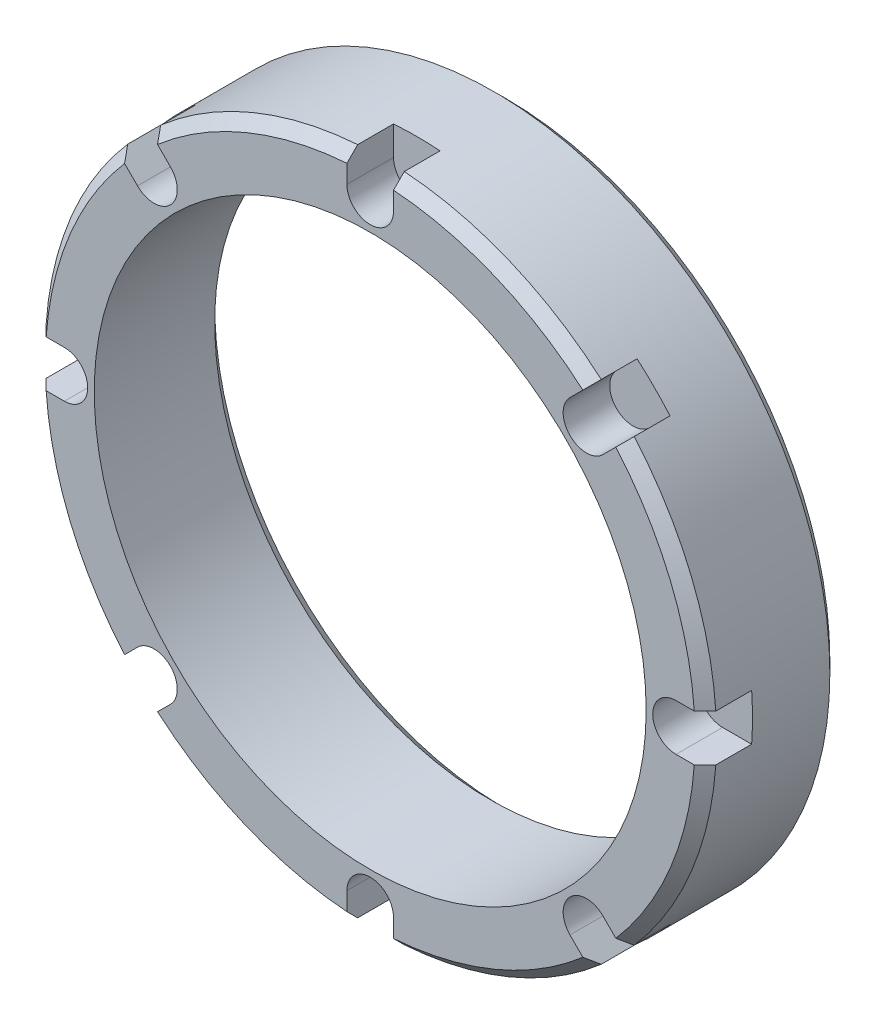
ISO-10303-21;
HEADER;
FILE_DESCRIPTION(('STEP AP214'),'2;1');
FILE_NAME('part.step','',(''),(''),'','','');
FILE_SCHEMA(('AUTOMOTIVE_DESIGN { 1 0 10303 214 1 1 1 1 }'));
ENDSEC;
DATA;
#1=APPLICATION_CONTEXT('core data for automotive mechanical design processes');
#2=APPLICATION_PROTOCOL_DEFINITION('international standard','automotive_design',2000,#1);
#3=PRODUCT_CONTEXT('',#1,'mechanical');
#4=PRODUCT('Part','Part','',(#3));
#5=PRODUCT_RELATED_PRODUCT_CATEGORY('part','',(#4));
#6=PRODUCT_DEFINITION_FORMATION('','',#4);
#7=PRODUCT_DEFINITION_CONTEXT('part definition',#1,'design');
#8=PRODUCT_DEFINITION('design','',#6,#7);
#9=PRODUCT_DEFINITION_SHAPE('','',#8);
#10=(LENGTH_UNIT() NAMED_UNIT(*) SI_UNIT(.MILLI.,.METRE.));
#11=(NAMED_UNIT(*) PLANE_ANGLE_UNIT() SI_UNIT($,.RADIAN.));
#12=(NAMED_UNIT(*) SI_UNIT($,.STERADIAN.) SOLID_ANGLE_UNIT());
#13=UNCERTAINTY_MEASURE_WITH_UNIT(LENGTH_MEASURE(1.E-05),#10,'distance_accuracy_value','');
#14=(GEOMETRIC_REPRESENTATION_CONTEXT(3) GLOBAL_UNCERTAINTY_ASSIGNED_CONTEXT((#13)) GLOBAL_UNIT_ASSIGNED_CONTEXT((#10,
#11,#12)) REPRESENTATION_CONTEXT('',''));
#15=CARTESIAN_POINT('',(0.,0.,0.));
#16=DIRECTION('',(0.,0.,1.));
#17=DIRECTION('',(1.,0.,0.));
#18=AXIS2_PLACEMENT_3D('',#15,#16,#17);
#19=CARTESIAN_POINT('',(0.,0.,2.0066));
#20=DIRECTION('',(0.,0.,-1.));
#21=DIRECTION('',(-1.,0.,0.));
#22=AXIS2_PLACEMENT_3D('',#19,#20,#21);
#23=CONICAL_SURFACE('',#22,11.89355,0.785398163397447);
#24=CARTESIAN_POINT('',(0.,0.,2.3876));
#25=DIRECTION('',(0.,0.,1.));
#26=DIRECTION('',(1.,0.,0.));
#27=AXIS2_PLACEMENT_3D('',#24,#25,#26);
#28=CIRCLE('',#27,11.51255);
#29=CARTESIAN_POINT('',(7.53593104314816,8.70336433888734,2.3876));
#30=VERTEX_POINT('',#29);
#31=CARTESIAN_POINT('',(0.8255,11.4829158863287,2.3876));
#32=VERTEX_POINT('',#31);
#33=EDGE_CURVE('E973',#30,#32,#28,.T.);
#34=ORIENTED_EDGE('',*,*,#33,.F.);
#35=CARTESIAN_POINT('',(6.4966875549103,7.66412085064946,3.85297638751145));
#36=CARTESIAN_POINT('',(6.68199788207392,7.84943117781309,3.59179200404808));
#37=CARTESIAN_POINT('',(6.86728507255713,8.0347183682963,3.33057479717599));
#38=CARTESIAN_POINT('',(7.23782018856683,8.40525348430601,2.80808470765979));
#39=CARTESIAN_POINT('',(7.42306811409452,8.59050140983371,2.54681182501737));
#40=CARTESIAN_POINT('',(7.97876352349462,9.14619681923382,1.76292459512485));
#41=CARTESIAN_POINT('',(8.34916263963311,9.51659593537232,1.24024166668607));
#42=CARTESIAN_POINT('',(8.71952532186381,9.88695861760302,0.717507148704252));
#43=B_SPLINE_CURVE_WITH_KNOTS('',3,(#35,#36,#37,#38,#39,#40,#41,#42),.UNSPECIFIED.,.F.,.F.,(4,2,
2,4),(0.,1.10998829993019,2.219976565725,4.43995310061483),.UNSPECIFIED.);
#44=CARTESIAN_POINT('',(7.80601163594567,8.97344493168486,2.0066));
#45=VERTEX_POINT('',#44);
#46=EDGE_CURVE('E493',#30,#45,#43,.T.);
#47=ORIENTED_EDGE('',*,*,#46,.T.);
#48=CARTESIAN_POINT('',(0.,0.,2.0066));
#49=DIRECTION('',(0.,0.,1.));
#50=DIRECTION('',(1.,0.,0.));
#51=AXIS2_PLACEMENT_3D('',#48,#49,#50);
#52=CIRCLE('',#51,11.89355);
#53=CARTESIAN_POINT('',(0.8255,11.8648675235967,2.0066));
#54=VERTEX_POINT('',#53);
#55=EDGE_CURVE('E1059',#45,#54,#52,.T.);
#56=ORIENTED_EDGE('',*,*,#55,.T.);
#57=CARTESIAN_POINT('',(0.8255,13.1567709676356,0.717507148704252));
#58=CARTESIAN_POINT('',(0.8255,12.6329990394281,1.24024166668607));
#59=CARTESIAN_POINT('',(0.8255,12.109175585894,1.76292459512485));
#60=CARTESIAN_POINT('',(0.8255,11.3233036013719,2.54681182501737));
#61=CARTESIAN_POINT('',(0.8255,11.0613234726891,2.80808470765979));
#62=CARTESIAN_POINT('',(0.8255,10.5373076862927,3.33057479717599));
#63=CARTESIAN_POINT('',(0.8255,10.2752720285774,3.59179200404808));
#64=CARTESIAN_POINT('',(0.8255,10.0132036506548,3.85297638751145));
#65=B_SPLINE_CURVE_WITH_KNOTS('',3,(#57,#58,#59,#60,#61,#62,#63,#64),.UNSPECIFIED.,.F.,.F.,(4,2,
2,4),(0.,2.21997653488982,3.32996480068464,4.43995310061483),.UNSPECIFIED.);
#66=EDGE_CURVE('E915',#54,#32,#65,.T.);
#67=ORIENTED_EDGE('',*,*,#66,.T.);
#68=EDGE_LOOP('',(#34,#47,#56,#67));
#69=FACE_BOUND('',#68,.T.);
#70=ADVANCED_FACE('F97',(#69),#23,.T.);
#71=CARTESIAN_POINT('',(11.8648675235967,0.825500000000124,2.0066));
#72=VERTEX_POINT('',#71);
#73=CARTESIAN_POINT('',(8.97344493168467,7.80601163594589,2.0066));
#74=VERTEX_POINT('',#73);
#75=EDGE_CURVE('E1044',#72,#74,#52,.T.);
#76=ORIENTED_EDGE('',*,*,#75,.T.);
#77=CARTESIAN_POINT('',(9.88695861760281,8.71952532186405,0.717507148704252));
#78=CARTESIAN_POINT('',(9.51659593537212,8.34916263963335,1.24024166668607));
#79=CARTESIAN_POINT('',(9.14619681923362,7.97876352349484,1.76292459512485));
#80=CARTESIAN_POINT('',(8.59050140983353,7.42306811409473,2.54681182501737));
#81=CARTESIAN_POINT('',(8.40525348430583,7.23782018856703,2.80808470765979));
#82=CARTESIAN_POINT('',(8.03471836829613,6.86728507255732,3.33057479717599));
#83=CARTESIAN_POINT('',(7.84943117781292,6.68199788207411,3.59179200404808));
#84=CARTESIAN_POINT('',(7.66412085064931,6.49668755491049,3.85297638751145));
#85=B_SPLINE_CURVE_WITH_KNOTS('',3,(#77,#78,#79,#80,#81,#82,#83,#84),.UNSPECIFIED.,.F.,.F.,(4,2,
2,4),(0.,2.21997653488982,3.32996480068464,4.43995310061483),.UNSPECIFIED.);
#86=CARTESIAN_POINT('',(8.70336433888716,7.53593104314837,2.3876));
#87=VERTEX_POINT('',#86);
#88=EDGE_CURVE('E461',#74,#87,#85,.T.);
#89=ORIENTED_EDGE('',*,*,#88,.T.);
#90=CARTESIAN_POINT('',(11.4829158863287,0.82550000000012,2.3876));
#91=VERTEX_POINT('',#90);
#92=EDGE_CURVE('E459',#91,#87,#28,.T.);
#93=ORIENTED_EDGE('',*,*,#92,.F.);
#94=CARTESIAN_POINT('',(10.0132036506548,0.825500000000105,3.85297638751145));
#95=CARTESIAN_POINT('',(10.2752720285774,0.825500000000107,3.59179200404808));
#96=CARTESIAN_POINT('',(10.5373076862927,0.82550000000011,3.330574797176));
#97=CARTESIAN_POINT('',(11.0613234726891,0.825500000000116,2.80808470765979));
#98=CARTESIAN_POINT('',(11.3233036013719,0.825500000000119,2.54681182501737));
#99=CARTESIAN_POINT('',(12.109175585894,0.825500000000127,1.76292459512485));
#100=CARTESIAN_POINT('',(12.6329990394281,0.825500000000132,1.24024166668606));
#101=CARTESIAN_POINT('',(13.1567709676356,0.825500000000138,0.717507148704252));
#102=B_SPLINE_CURVE_WITH_KNOTS('',3,(#94,#95,#96,#97,#98,#99,#100,#101),.UNSPECIFIED.,.F.,.F.,
(4,2,2,4),(0.,1.10998829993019,2.219976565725,4.43995310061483),.UNSPECIFIED.);
#103=EDGE_CURVE('E555',#91,#72,#102,.T.);
#104=ORIENTED_EDGE('',*,*,#103,.T.);
#105=EDGE_LOOP('',(#76,#89,#93,#104));
#106=FACE_BOUND('',#105,.T.);
#107=ADVANCED_FACE('F965',(#106),#23,.T.);
#108=CARTESIAN_POINT('',(8.97344493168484,-7.8060116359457,2.0066));
#109=VERTEX_POINT('',#108);
#110=CARTESIAN_POINT('',(11.8648675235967,-0.825499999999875,2.0066));
#111=VERTEX_POINT('',#110);
#112=EDGE_CURVE('E1031',#109,#111,#52,.T.);
#113=ORIENTED_EDGE('',*,*,#112,.T.);
#114=CARTESIAN_POINT('',(13.1567709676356,-0.825499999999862,0.717507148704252));
#115=CARTESIAN_POINT('',(12.6329990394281,-0.825499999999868,1.24024166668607));
#116=CARTESIAN_POINT('',(12.109175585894,-0.825499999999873,1.76292459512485));
#117=CARTESIAN_POINT('',(11.3233036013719,-0.825499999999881,2.54681182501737));
#118=CARTESIAN_POINT('',(11.0613234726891,-0.825499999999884,2.80808470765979));
#119=CARTESIAN_POINT('',(10.5373076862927,-0.82549999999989,3.33057479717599));
#120=CARTESIAN_POINT('',(10.2752720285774,-0.825499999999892,3.59179200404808));
#121=CARTESIAN_POINT('',(10.0132036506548,-0.825499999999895,3.85297638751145));
#122=B_SPLINE_CURVE_WITH_KNOTS('',3,(#114,#115,#116,#117,#118,#119,#120,#121),.UNSPECIFIED.,.F.,
.F.,(4,2,2,4),(0.,2.21997653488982,3.32996480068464,4.43995310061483),.UNSPECIFIED.);
#123=CARTESIAN_POINT('',(11.4829158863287,-0.82549999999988,2.3876));
#124=VERTEX_POINT('',#123);
#125=EDGE_CURVE('E528',#111,#124,#122,.T.);
#126=ORIENTED_EDGE('',*,*,#125,.T.);
#127=CARTESIAN_POINT('',(8.70336433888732,-7.53593104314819,2.3876));
#128=VERTEX_POINT('',#127);
#129=EDGE_CURVE('E981',#128,#124,#28,.T.);
#130=ORIENTED_EDGE('',*,*,#129,.F.);
#131=CARTESIAN_POINT('',(7.66412085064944,-6.49668755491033,3.85297638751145));
#132=CARTESIAN_POINT('',(7.84943117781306,-6.68199788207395,3.59179200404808));
#133=CARTESIAN_POINT('',(8.03471836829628,-6.86728507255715,3.330574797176));
#134=CARTESIAN_POINT('',(8.40525348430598,-7.23782018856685,2.80808470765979));
#135=CARTESIAN_POINT('',(8.59050140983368,-7.42306811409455,2.54681182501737));
#136=CARTESIAN_POINT('',(9.14619681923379,-7.97876352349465,1.76292459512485));
#137=CARTESIAN_POINT('',(9.51659593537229,-8.34916263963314,1.24024166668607));
#138=CARTESIAN_POINT('',(9.88695861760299,-8.71952532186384,0.717507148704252));
#139=B_SPLINE_CURVE_WITH_KNOTS('',3,(#131,#132,#133,#134,#135,#136,#137,#138),.UNSPECIFIED.,.F.,
.F.,(4,2,2,4),(0.,1.10998829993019,2.219976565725,4.43995310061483),.UNSPECIFIED.);
#140=EDGE_CURVE('E619',#128,#109,#139,.T.);
#141=ORIENTED_EDGE('',*,*,#140,.T.);
#142=EDGE_LOOP('',(#113,#126,#130,#141));
#143=FACE_BOUND('',#142,.T.);
#144=ADVANCED_FACE('F970',(#143),#23,.T.);
#145=CARTESIAN_POINT('',(0.8255,-11.8648675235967,2.0066));
#146=VERTEX_POINT('',#145);
#147=CARTESIAN_POINT('',(7.80601163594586,-8.9734449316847,2.0066));
#148=VERTEX_POINT('',#147);
#149=EDGE_CURVE('E1063',#146,#148,#52,.T.);
#150=ORIENTED_EDGE('',*,*,#149,.T.);
#151=CARTESIAN_POINT('',(8.71952532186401,-9.88695861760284,0.717507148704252));
#152=CARTESIAN_POINT('',(8.34916263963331,-9.51659593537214,1.24024166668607));
#153=CARTESIAN_POINT('',(7.97876352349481,-9.14619681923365,1.76292459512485));
#154=CARTESIAN_POINT('',(7.4230681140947,-8.59050140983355,2.54681182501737));
#155=CARTESIAN_POINT('',(7.237820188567,-8.40525348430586,2.80808470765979));
#156=CARTESIAN_POINT('',(6.8672850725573,-8.03471836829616,3.33057479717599));
#157=CARTESIAN_POINT('',(6.68199788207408,-7.84943117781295,3.59179200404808));
#158=CARTESIAN_POINT('',(6.49668755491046,-7.66412085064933,3.85297638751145));
#159=B_SPLINE_CURVE_WITH_KNOTS('',3,(#151,#152,#153,#154,#155,#156,#157,#158),.UNSPECIFIED.,.F.,
.F.,(4,2,2,4),(0.,2.21997653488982,3.32996480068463,4.43995310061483),.UNSPECIFIED.);
#160=CARTESIAN_POINT('',(7.53593104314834,-8.70336433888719,2.3876));
#161=VERTEX_POINT('',#160);
#162=EDGE_CURVE('E591',#148,#161,#159,.T.);
#163=ORIENTED_EDGE('',*,*,#162,.T.);
#164=CARTESIAN_POINT('',(0.8255,-11.4829158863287,2.3876));
#165=VERTEX_POINT('',#164);
#166=EDGE_CURVE('E1010',#165,#161,#28,.T.);
#167=ORIENTED_EDGE('',*,*,#166,.F.);
#168=CARTESIAN_POINT('',(0.8255,-10.0132036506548,3.85297638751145));
#169=CARTESIAN_POINT('',(0.8255,-10.2752720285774,3.59179200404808));
#170=CARTESIAN_POINT('',(0.8255,-10.5373076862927,3.330574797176));
#171=CARTESIAN_POINT('',(0.8255,-11.0613234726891,2.80808470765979));
#172=CARTESIAN_POINT('',(0.8255,-11.3233036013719,2.54681182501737));
#173=CARTESIAN_POINT('',(0.8255,-12.109175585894,1.76292459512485));
#174=CARTESIAN_POINT('',(0.8255,-12.6329990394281,1.24024166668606));
#175=CARTESIAN_POINT('',(0.8255,-13.1567709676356,0.717507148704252));
#176=B_SPLINE_CURVE_WITH_KNOTS('',3,(#168,#169,#170,#171,#172,#173,#174,#175),.UNSPECIFIED.,.F.,
.F.,(4,2,2,4),(0.,1.10998829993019,2.219976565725,4.43995310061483),.UNSPECIFIED.);
#177=EDGE_CURVE('E683',#165,#146,#176,.T.);
#178=ORIENTED_EDGE('',*,*,#177,.T.);
#179=EDGE_LOOP('',(#150,#163,#167,#178));
#180=FACE_BOUND('',#179,.T.);
#181=ADVANCED_FACE('F1303',(#180),#23,.T.);
#182=CARTESIAN_POINT('',(-7.80601163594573,-8.97344493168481,2.0066));
#183=VERTEX_POINT('',#182);
#184=CARTESIAN_POINT('',(-0.8255,-11.8648675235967,2.0066));
#185=VERTEX_POINT('',#184);
#186=EDGE_CURVE('E1067',#183,#185,#52,.T.);
#187=ORIENTED_EDGE('',*,*,#186,.T.);
#188=CARTESIAN_POINT('',(-0.8255,-13.1567709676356,0.717507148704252));
#189=CARTESIAN_POINT('',(-0.8255,-12.6329990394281,1.24024166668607));
#190=CARTESIAN_POINT('',(-0.8255,-12.109175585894,1.76292459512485));
#191=CARTESIAN_POINT('',(-0.8255,-11.3233036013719,2.54681182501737));
#192=CARTESIAN_POINT('',(-0.8255,-11.0613234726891,2.80808470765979));
#193=CARTESIAN_POINT('',(-0.8255,-10.5373076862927,3.33057479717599));
#194=CARTESIAN_POINT('',(-0.8255,-10.2752720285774,3.59179200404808));
#195=CARTESIAN_POINT('',(-0.8255,-10.0132036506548,3.85297638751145));
#196=B_SPLINE_CURVE_WITH_KNOTS('',3,(#188,#189,#190,#191,#192,#193,#194,#195),.UNSPECIFIED.,.F.,
.F.,(4,2,2,4),(0.,2.21997653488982,3.32996480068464,4.43995310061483),.UNSPECIFIED.);
#197=CARTESIAN_POINT('',(-0.8255,-11.4829158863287,2.3876));
#198=VERTEX_POINT('',#197);
#199=EDGE_CURVE('E655',#185,#198,#196,.T.);
#200=ORIENTED_EDGE('',*,*,#199,.T.);
#201=CARTESIAN_POINT('',(-7.53593104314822,-8.70336433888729,2.3876));
#202=VERTEX_POINT('',#201);
#203=EDGE_CURVE('E1003',#202,#198,#28,.T.);
#204=ORIENTED_EDGE('',*,*,#203,.F.);
#205=CARTESIAN_POINT('',(-6.49668755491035,-7.66412085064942,3.85297638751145));
#206=CARTESIAN_POINT('',(-6.68199788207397,-7.84943117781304,3.59179200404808));
#207=CARTESIAN_POINT('',(-6.86728507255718,-8.03471836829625,3.330574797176));
#208=CARTESIAN_POINT('',(-7.23782018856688,-8.40525348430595,2.80808470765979));
#209=CARTESIAN_POINT('',(-7.42306811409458,-8.59050140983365,2.54681182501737));
#210=CARTESIAN_POINT('',(-7.97876352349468,-9.14619681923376,1.76292459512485));
#211=CARTESIAN_POINT('',(-8.34916263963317,-9.51659593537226,1.24024166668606));
#212=CARTESIAN_POINT('',(-8.71952532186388,-9.88695861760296,0.717507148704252));
#213=B_SPLINE_CURVE_WITH_KNOTS('',3,(#205,#206,#207,#208,#209,#210,#211,#212),.UNSPECIFIED.,.F.,
.F.,(4,2,2,4),(0.,1.10998829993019,2.219976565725,4.43995310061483),.UNSPECIFIED.);
#214=EDGE_CURVE('E747',#202,#183,#213,.T.);
#215=ORIENTED_EDGE('',*,*,#214,.T.);
#216=EDGE_LOOP('',(#187,#200,#204,#215));
#217=FACE_BOUND('',#216,.T.);
#218=ADVANCED_FACE('F1295',(#217),#23,.T.);
#219=CARTESIAN_POINT('',(-11.8648675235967,-0.825500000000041,2.0066));
#220=VERTEX_POINT('',#219);
#221=CARTESIAN_POINT('',(-8.97344493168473,-7.80601163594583,2.0066));
#222=VERTEX_POINT('',#221);
#223=EDGE_CURVE('E1453',#220,#222,#52,.T.);
#224=ORIENTED_EDGE('',*,*,#223,.T.);
#225=CARTESIAN_POINT('',(-9.88695861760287,-8.71952532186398,0.717507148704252));
#226=CARTESIAN_POINT('',(-9.51659593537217,-8.34916263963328,1.24024166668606));
#227=CARTESIAN_POINT('',(-9.14619681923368,-7.97876352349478,1.76292459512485));
#228=CARTESIAN_POINT('',(-8.59050140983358,-7.42306811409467,2.54681182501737));
#229=CARTESIAN_POINT('',(-8.40525348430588,-7.23782018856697,2.80808470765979));
#230=CARTESIAN_POINT('',(-8.03471836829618,-6.86728507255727,3.33057479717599));
#231=CARTESIAN_POINT('',(-7.84943117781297,-6.68199788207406,3.59179200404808));
#232=CARTESIAN_POINT('',(-7.66412085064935,-6.49668755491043,3.85297638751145));
#233=B_SPLINE_CURVE_WITH_KNOTS('',3,(#225,#226,#227,#228,#229,#230,#231,#232),.UNSPECIFIED.,.F.,
.F.,(4,2,2,4),(0.,2.21997653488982,3.32996480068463,4.43995310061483),.UNSPECIFIED.);
#234=CARTESIAN_POINT('',(-8.70336433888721,-7.53593104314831,2.3876));
#235=VERTEX_POINT('',#234);
#236=EDGE_CURVE('E719',#222,#235,#233,.T.);
#237=ORIENTED_EDGE('',*,*,#236,.T.);
#238=CARTESIAN_POINT('',(-11.4829158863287,-0.82550000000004,2.3876));
#239=VERTEX_POINT('',#238);
#240=EDGE_CURVE('E997',#239,#235,#28,.T.);
#241=ORIENTED_EDGE('',*,*,#240,.F.);
#242=CARTESIAN_POINT('',(-10.0132036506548,-0.825500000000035,3.85297638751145));
#243=CARTESIAN_POINT('',(-10.2752720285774,-0.825500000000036,3.59179200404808));
#244=CARTESIAN_POINT('',(-10.5373076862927,-0.825500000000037,3.330574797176));
#245=CARTESIAN_POINT('',(-11.0613234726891,-0.825500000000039,2.80808470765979));
#246=CARTESIAN_POINT('',(-11.3233036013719,-0.82550000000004,2.54681182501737));
#247=CARTESIAN_POINT('',(-12.109175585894,-0.825500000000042,1.76292459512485));
#248=CARTESIAN_POINT('',(-12.6329990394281,-0.825500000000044,1.24024166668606));
#249=CARTESIAN_POINT('',(-13.1567709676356,-0.825500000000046,0.717507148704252));
#250=B_SPLINE_CURVE_WITH_KNOTS('',3,(#242,#243,#244,#245,#246,#247,#248,#249),.UNSPECIFIED.,.F.,
.F.,(4,2,2,4),(0.,1.10998829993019,2.219976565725,4.43995310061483),.UNSPECIFIED.);
#251=EDGE_CURVE('E811',#239,#220,#250,.T.);
#252=ORIENTED_EDGE('',*,*,#251,.T.);
#253=EDGE_LOOP('',(#224,#237,#241,#252));
#254=FACE_BOUND('',#253,.T.);
#255=ADVANCED_FACE('F1286',(#254),#23,.T.);
#256=CARTESIAN_POINT('',(-8.97344493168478,7.80601163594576,2.0066));
#257=VERTEX_POINT('',#256);
#258=CARTESIAN_POINT('',(-11.8648675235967,0.825499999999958,2.0066));
#259=VERTEX_POINT('',#258);
#260=EDGE_CURVE('E1075',#257,#259,#52,.T.);
#261=ORIENTED_EDGE('',*,*,#260,.T.);
#262=CARTESIAN_POINT('',(-13.1567709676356,0.825499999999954,0.717507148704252));
#263=CARTESIAN_POINT('',(-12.6329990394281,0.825499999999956,1.24024166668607));
#264=CARTESIAN_POINT('',(-12.109175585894,0.825499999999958,1.76292459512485));
#265=CARTESIAN_POINT('',(-11.3233036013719,0.82549999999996,2.54681182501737));
#266=CARTESIAN_POINT('',(-11.0613234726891,0.825499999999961,2.80808470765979));
#267=CARTESIAN_POINT('',(-10.5373076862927,0.825499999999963,3.33057479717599));
#268=CARTESIAN_POINT('',(-10.2752720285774,0.825499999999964,3.59179200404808));
#269=CARTESIAN_POINT('',(-10.0132036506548,0.825499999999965,3.85297638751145));
#270=B_SPLINE_CURVE_WITH_KNOTS('',3,(#262,#263,#264,#265,#266,#267,#268,#269),.UNSPECIFIED.,.F.,
.F.,(4,2,2,4),(0.,2.21997653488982,3.32996480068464,4.43995310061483),.UNSPECIFIED.);
#271=CARTESIAN_POINT('',(-11.4829158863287,0.82549999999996,2.3876));
#272=VERTEX_POINT('',#271);
#273=EDGE_CURVE('E783',#259,#272,#270,.T.);
#274=ORIENTED_EDGE('',*,*,#273,.T.);
#275=CARTESIAN_POINT('',(-8.70336433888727,7.53593104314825,2.3876));
#276=VERTEX_POINT('',#275);
#277=EDGE_CURVE('E988',#276,#272,#28,.T.);
#278=ORIENTED_EDGE('',*,*,#277,.F.);
#279=CARTESIAN_POINT('',(-7.6641208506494,6.49668755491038,3.85297638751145));
#280=CARTESIAN_POINT('',(-7.84943117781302,6.681997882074,3.59179200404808));
#281=CARTESIAN_POINT('',(-8.03471836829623,6.86728507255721,3.33057479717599));
#282=CARTESIAN_POINT('',(-8.40525348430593,7.23782018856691,2.80808470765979));
#283=CARTESIAN_POINT('',(-8.59050140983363,7.42306811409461,2.54681182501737));
#284=CARTESIAN_POINT('',(-9.14619681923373,7.97876352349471,1.76292459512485));
#285=CARTESIAN_POINT('',(-9.51659593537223,8.34916263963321,1.24024166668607));
#286=CARTESIAN_POINT('',(-9.88695861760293,8.71952532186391,0.717507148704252));
#287=B_SPLINE_CURVE_WITH_KNOTS('',3,(#279,#280,#281,#282,#283,#284,#285,#286),.UNSPECIFIED.,.F.,
.F.,(4,2,2,4),(0.,1.10998829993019,2.219976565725,4.43995310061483),.UNSPECIFIED.);
#288=EDGE_CURVE('E875',#276,#257,#287,.T.);
#289=ORIENTED_EDGE('',*,*,#288,.T.);
#290=EDGE_LOOP('',(#261,#274,#278,#289));
#291=FACE_BOUND('',#290,.T.);
#292=ADVANCED_FACE('F960',(#291),#23,.T.);
#293=CARTESIAN_POINT('',(-0.8255,11.8648675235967,2.0066));
#294=VERTEX_POINT('',#293);
#295=CARTESIAN_POINT('',(-7.80601163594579,8.97344493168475,2.0066));
#296=VERTEX_POINT('',#295);
#297=EDGE_CURVE('E1069',#294,#296,#52,.T.);
#298=ORIENTED_EDGE('',*,*,#297,.T.);
#299=CARTESIAN_POINT('',(-8.71952532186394,9.8869586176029,0.717507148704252));
#300=CARTESIAN_POINT('',(-8.34916263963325,9.5165959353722,1.24024166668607));
#301=CARTESIAN_POINT('',(-7.97876352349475,9.14619681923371,1.76292459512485));
#302=CARTESIAN_POINT('',(-7.42306811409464,8.5905014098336,2.54681182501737));
#303=CARTESIAN_POINT('',(-7.23782018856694,8.40525348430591,2.80808470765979));
#304=CARTESIAN_POINT('',(-6.86728507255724,8.0347183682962,3.33057479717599));
#305=CARTESIAN_POINT('',(-6.68199788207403,7.84943117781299,3.59179200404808));
#306=CARTESIAN_POINT('',(-6.49668755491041,7.66412085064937,3.85297638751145));
#307=B_SPLINE_CURVE_WITH_KNOTS('',3,(#299,#300,#301,#302,#303,#304,#305,#306),.UNSPECIFIED.,.F.,
.F.,(4,2,2,4),(0.,2.21997653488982,3.32996480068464,4.43995310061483),.UNSPECIFIED.);
#308=CARTESIAN_POINT('',(-7.53593104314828,8.70336433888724,2.3876));
#309=VERTEX_POINT('',#308);
#310=EDGE_CURVE('E847',#296,#309,#307,.T.);
#311=ORIENTED_EDGE('',*,*,#310,.T.);
#312=CARTESIAN_POINT('',(-0.8255,11.4829158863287,2.3876));
#313=VERTEX_POINT('',#312);
#314=EDGE_CURVE('E979',#313,#309,#28,.T.);
#315=ORIENTED_EDGE('',*,*,#314,.F.);
#316=CARTESIAN_POINT('',(-0.8255,10.0132036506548,3.85297638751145));
#317=CARTESIAN_POINT('',(-0.8255,10.2752720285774,3.59179200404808));
#318=CARTESIAN_POINT('',(-0.8255,10.5373076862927,3.330574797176));
#319=CARTESIAN_POINT('',(-0.8255,11.0613234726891,2.80808470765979));
#320=CARTESIAN_POINT('',(-0.8255,11.3233036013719,2.54681182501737));
#321=CARTESIAN_POINT('',(-0.8255,12.109175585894,1.76292459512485));
#322=CARTESIAN_POINT('',(-0.8255,12.6329990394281,1.24024166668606));
#323=CARTESIAN_POINT('',(-0.8255,13.1567709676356,0.717507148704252));
#324=B_SPLINE_CURVE_WITH_KNOTS('',3,(#316,#317,#318,#319,#320,#321,#322,#323),.UNSPECIFIED.,.F.,
.F.,(4,2,2,4),(0.,1.10998829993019,2.219976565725,4.43995310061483),.UNSPECIFIED.);
#325=EDGE_CURVE('E977',#313,#294,#324,.T.);
#326=ORIENTED_EDGE('',*,*,#325,.T.);
#327=EDGE_LOOP('',(#298,#311,#315,#326));
#328=FACE_BOUND('',#327,.T.);
#329=ADVANCED_FACE('F925',(#328),#23,.T.);
#330=CARTESIAN_POINT('',(0.,0.,2.3876));
#331=DIRECTION('',(0.,0.,1.));
#332=DIRECTION('',(1.,0.,0.));
#333=AXIS2_PLACEMENT_3D('',#330,#331,#332);
#334=CYLINDRICAL_SURFACE('',#333,11.89355);
#335=ORIENTED_EDGE('',*,*,#55,.F.);
#336=DIRECTION('',(0.,0.,1.));
#337=VECTOR('',#336,1.);
#338=CARTESIAN_POINT('',(7.80601163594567,8.97344493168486,2.3876));
#339=LINE('',#338,#337);
#340=CARTESIAN_POINT('',(7.80601163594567,8.97344493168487,0.7366));
#341=VERTEX_POINT('',#340);
#342=EDGE_CURVE('E502',#45,#341,#339,.F.);
#343=ORIENTED_EDGE('',*,*,#342,.T.);
#344=CARTESIAN_POINT('',(0.,0.,0.7366));
#345=DIRECTION('',(0.,0.,1.));
#346=DIRECTION('',(0.707106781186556,-0.707106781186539,0.));
#347=AXIS2_PLACEMENT_3D('',#344,#345,#346);
#348=CIRCLE('',#347,11.89355);
#349=CARTESIAN_POINT('',(8.97344493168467,7.80601163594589,0.7366));
#350=VERTEX_POINT('',#349);
#351=EDGE_CURVE('E465',#350,#341,#348,.T.);
#352=ORIENTED_EDGE('',*,*,#351,.F.);
#353=DIRECTION('',(0.,0.,1.));
#354=VECTOR('',#353,1.);
#355=CARTESIAN_POINT('',(8.97344493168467,7.80601163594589,2.3876));
#356=LINE('',#355,#354);
#357=EDGE_CURVE('E468',#350,#74,#356,.T.);
#358=ORIENTED_EDGE('',*,*,#357,.T.);
#359=ORIENTED_EDGE('',*,*,#75,.F.);
#360=DIRECTION('',(0.,0.,1.));
#361=VECTOR('',#360,1.);
#362=CARTESIAN_POINT('',(11.8648675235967,0.825500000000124,2.3876));
#363=LINE('',#362,#361);
#364=CARTESIAN_POINT('',(11.8648675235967,0.825500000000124,0.7366));
#365=VERTEX_POINT('',#364);
#366=EDGE_CURVE('E564',#72,#365,#363,.F.);
#367=ORIENTED_EDGE('',*,*,#366,.T.);
#368=CARTESIAN_POINT('',(0.,0.,0.7366));
#369=DIRECTION('',(0.,0.,1.));
#370=DIRECTION('',(0.,-1.,0.));
#371=AXIS2_PLACEMENT_3D('',#368,#369,#370);
#372=CIRCLE('',#371,11.89355);
#373=CARTESIAN_POINT('',(11.8648675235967,-0.825499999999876,0.7366));
#374=VERTEX_POINT('',#373);
#375=EDGE_CURVE('E537',#374,#365,#372,.T.);
#376=ORIENTED_EDGE('',*,*,#375,.F.);
#377=DIRECTION('',(0.,0.,1.));
#378=VECTOR('',#377,1.);
#379=CARTESIAN_POINT('',(11.8648675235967,-0.825499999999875,2.3876));
#380=LINE('',#379,#378);
#381=EDGE_CURVE('E517',#374,#111,#380,.T.);
#382=ORIENTED_EDGE('',*,*,#381,.T.);
#383=ORIENTED_EDGE('',*,*,#112,.F.);
#384=DIRECTION('',(0.,0.,1.));
#385=VECTOR('',#384,1.);
#386=CARTESIAN_POINT('',(8.97344493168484,-7.8060116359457,2.3876));
#387=LINE('',#386,#385);
#388=CARTESIAN_POINT('',(8.97344493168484,-7.8060116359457,0.7366));
#389=VERTEX_POINT('',#388);
#390=EDGE_CURVE('E628',#109,#389,#387,.F.);
#391=ORIENTED_EDGE('',*,*,#390,.T.);
#392=CARTESIAN_POINT('',(0.,0.,0.7366));
#393=DIRECTION('',(0.,0.,1.));
#394=DIRECTION('',(-0.707106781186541,-0.707106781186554,0.));
#395=AXIS2_PLACEMENT_3D('',#392,#393,#394);
#396=CIRCLE('',#395,11.89355);
#397=CARTESIAN_POINT('',(7.80601163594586,-8.9734449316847,0.7366));
#398=VERTEX_POINT('',#397);
#399=EDGE_CURVE('E600',#398,#389,#396,.T.);
#400=ORIENTED_EDGE('',*,*,#399,.F.);
#401=DIRECTION('',(0.,0.,1.));
#402=VECTOR('',#401,1.);
#403=CARTESIAN_POINT('',(7.80601163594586,-8.9734449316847,2.3876));
#404=LINE('',#403,#402);
#405=EDGE_CURVE('E580',#398,#148,#404,.T.);
#406=ORIENTED_EDGE('',*,*,#405,.T.);
#407=ORIENTED_EDGE('',*,*,#149,.F.);
#408=DIRECTION('',(0.,0.,1.));
#409=VECTOR('',#408,1.);
#410=CARTESIAN_POINT('',(0.8255,-11.8648675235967,2.3876));
#411=LINE('',#410,#409);
#412=CARTESIAN_POINT('',(0.8255,-11.8648675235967,0.7366));
#413=VERTEX_POINT('',#412);
#414=EDGE_CURVE('E692',#146,#413,#411,.F.);
#415=ORIENTED_EDGE('',*,*,#414,.T.);
#416=CARTESIAN_POINT('',(0.,0.,0.7366));
#417=DIRECTION('',(0.,0.,1.));
#418=DIRECTION('',(-1.,0.,0.));
#419=AXIS2_PLACEMENT_3D('',#416,#417,#418);
#420=CIRCLE('',#419,11.89355);
#421=CARTESIAN_POINT('',(-0.8255,-11.8648675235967,0.7366));
#422=VERTEX_POINT('',#421);
#423=EDGE_CURVE('E664',#422,#413,#420,.T.);
#424=ORIENTED_EDGE('',*,*,#423,.F.);
#425=DIRECTION('',(0.,0.,1.));
#426=VECTOR('',#425,1.);
#427=CARTESIAN_POINT('',(-0.8255,-11.8648675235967,2.3876));
#428=LINE('',#427,#426);
#429=EDGE_CURVE('E644',#422,#185,#428,.T.);
#430=ORIENTED_EDGE('',*,*,#429,.T.);
#431=ORIENTED_EDGE('',*,*,#186,.F.);
#432=DIRECTION('',(0.,0.,1.));
#433=VECTOR('',#432,1.);
#434=CARTESIAN_POINT('',(-7.80601163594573,-8.97344493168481,2.3876));
#435=LINE('',#434,#433);
#436=CARTESIAN_POINT('',(-7.80601163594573,-8.97344493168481,0.7366));
#437=VERTEX_POINT('',#436);
#438=EDGE_CURVE('E756',#183,#437,#435,.F.);
#439=ORIENTED_EDGE('',*,*,#438,.T.);
#440=CARTESIAN_POINT('',(0.,0.,0.7366));
#441=DIRECTION('',(0.,0.,1.));
#442=DIRECTION('',(-0.707106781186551,0.707106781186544,0.));
#443=AXIS2_PLACEMENT_3D('',#440,#441,#442);
#444=CIRCLE('',#443,11.89355);
#445=CARTESIAN_POINT('',(-8.97344493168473,-7.80601163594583,0.7366));
#446=VERTEX_POINT('',#445);
#447=EDGE_CURVE('E728',#446,#437,#444,.T.);
#448=ORIENTED_EDGE('',*,*,#447,.F.);
#449=DIRECTION('',(0.,0.,1.));
#450=VECTOR('',#449,1.);
#451=CARTESIAN_POINT('',(-8.97344493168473,-7.80601163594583,2.3876));
#452=LINE('',#451,#450);
#453=EDGE_CURVE('E708',#446,#222,#452,.T.);
#454=ORIENTED_EDGE('',*,*,#453,.T.);
#455=ORIENTED_EDGE('',*,*,#223,.F.);
#456=DIRECTION('',(0.,0.,1.));
#457=VECTOR('',#456,1.);
#458=CARTESIAN_POINT('',(-11.8648675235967,-0.825500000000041,2.3876));
#459=LINE('',#458,#457);
#460=CARTESIAN_POINT('',(-11.8648675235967,-0.825500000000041,0.7366));
#461=VERTEX_POINT('',#460);
#462=EDGE_CURVE('E820',#220,#461,#459,.F.);
#463=ORIENTED_EDGE('',*,*,#462,.T.);
#464=CARTESIAN_POINT('',(0.,0.,0.7366));
#465=DIRECTION('',(0.,0.,1.));
#466=DIRECTION('',(0.,1.,0.));
#467=AXIS2_PLACEMENT_3D('',#464,#465,#466);
#468=CIRCLE('',#467,11.89355);
#469=CARTESIAN_POINT('',(-11.8648675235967,0.825499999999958,0.7366));
#470=VERTEX_POINT('',#469);
#471=EDGE_CURVE('E792',#470,#461,#468,.T.);
#472=ORIENTED_EDGE('',*,*,#471,.F.);
#473=DIRECTION('',(0.,0.,1.));
#474=VECTOR('',#473,1.);
#475=CARTESIAN_POINT('',(-11.8648675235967,0.825499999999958,2.3876));
#476=LINE('',#475,#474);
#477=EDGE_CURVE('E772',#470,#259,#476,.T.);
#478=ORIENTED_EDGE('',*,*,#477,.T.);
#479=ORIENTED_EDGE('',*,*,#260,.F.);
#480=DIRECTION('',(0.,0.,1.));
#481=VECTOR('',#480,1.);
#482=CARTESIAN_POINT('',(-8.97344493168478,7.80601163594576,2.3876));
#483=LINE('',#482,#481);
#484=CARTESIAN_POINT('',(-8.97344493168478,7.80601163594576,0.7366));
#485=VERTEX_POINT('',#484);
#486=EDGE_CURVE('E884',#257,#485,#483,.F.);
#487=ORIENTED_EDGE('',*,*,#486,.T.);
#488=CARTESIAN_POINT('',(0.,0.,0.7366));
#489=DIRECTION('',(0.,0.,1.));
#490=DIRECTION('',(0.707106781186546,0.707106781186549,0.));
#491=AXIS2_PLACEMENT_3D('',#488,#489,#490);
#492=CIRCLE('',#491,11.89355);
#493=CARTESIAN_POINT('',(-7.8060116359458,8.97344493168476,0.7366));
#494=VERTEX_POINT('',#493);
#495=EDGE_CURVE('E856',#494,#485,#492,.T.);
#496=ORIENTED_EDGE('',*,*,#495,.F.);
#497=DIRECTION('',(0.,0.,1.));
#498=VECTOR('',#497,1.);
#499=CARTESIAN_POINT('',(-7.80601163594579,8.97344493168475,2.3876));
#500=LINE('',#499,#498);
#501=EDGE_CURVE('E836',#494,#296,#500,.T.);
#502=ORIENTED_EDGE('',*,*,#501,.T.);
#503=ORIENTED_EDGE('',*,*,#297,.F.);
#504=DIRECTION('',(0.,0.,1.));
#505=VECTOR('',#504,1.);
#506=CARTESIAN_POINT('',(-0.8255,11.8648675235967,2.3876));
#507=LINE('',#506,#505);
#508=CARTESIAN_POINT('',(-0.8255,11.8648675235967,0.7366));
#509=VERTEX_POINT('',#508);
#510=EDGE_CURVE('E923',#294,#509,#507,.F.);
#511=ORIENTED_EDGE('',*,*,#510,.T.);
#512=CARTESIAN_POINT('',(0.,0.,0.7366));
#513=DIRECTION('',(0.,0.,1.));
#514=DIRECTION('',(1.,0.,0.));
#515=AXIS2_PLACEMENT_3D('',#512,#513,#514);
#516=CIRCLE('',#515,11.89355);
#517=CARTESIAN_POINT('',(0.8255,11.8648675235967,0.7366));
#518=VERTEX_POINT('',#517);
#519=EDGE_CURVE('E1080',#518,#509,#516,.T.);
#520=ORIENTED_EDGE('',*,*,#519,.F.);
#521=DIRECTION('',(0.,0.,1.));
#522=VECTOR('',#521,1.);
#523=CARTESIAN_POINT('',(0.8255,11.8648675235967,2.3876));
#524=LINE('',#523,#522);
#525=EDGE_CURVE('E908',#518,#54,#524,.T.);
#526=ORIENTED_EDGE('',*,*,#525,.T.);
#527=EDGE_LOOP('',(#335,#343,#352,#358,#359,#367,#376,#382,#383,#391,#400,#406,#407,#415,#424,
#430,#431,#439,#448,#454,#455,#463,#472,#478,#479,#487,#496,#502,#503,#511,#520,#526));
#528=FACE_BOUND('',#527,.T.);
#529=CARTESIAN_POINT('',(0.,0.,-2.0066));
#530=DIRECTION('',(0.,0.,1.));
#531=DIRECTION('',(1.,0.,0.));
#532=AXIS2_PLACEMENT_3D('',#529,#530,#531);
#533=CIRCLE('',#532,11.89355);
#534=CARTESIAN_POINT('',(11.89355,0.,-2.0066));
#535=VERTEX_POINT('',#534);
#536=EDGE_CURVE('E1076',#535,#535,#533,.T.);
#537=ORIENTED_EDGE('',*,*,#536,.T.);
#538=EDGE_LOOP('',(#537));
#539=FACE_BOUND('',#538,.T.);
#540=ADVANCED_FACE('F953',(#528,#539),#334,.T.);
#541=CARTESIAN_POINT('',(0.,0.,-2.3876));
#542=DIRECTION('',(0.,0.,1.));
#543=DIRECTION('',(1.,0.,0.));
#544=AXIS2_PLACEMENT_3D('',#541,#542,#543);
#545=CONICAL_SURFACE('',#544,11.51255,0.785398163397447);
#546=ORIENTED_EDGE('',*,*,#536,.F.);
#547=EDGE_LOOP('',(#546));
#548=FACE_BOUND('',#547,.T.);
#549=CARTESIAN_POINT('',(0.,0.,-2.3876));
#550=DIRECTION('',(0.,0.,1.));
#551=DIRECTION('',(1.,0.,0.));
#552=AXIS2_PLACEMENT_3D('',#549,#550,#551);
#553=CIRCLE('',#552,11.51255);
#554=CARTESIAN_POINT('',(11.51255,0.,-2.3876));
#555=VERTEX_POINT('',#554);
#556=EDGE_CURVE('E994',#555,#555,#553,.T.);
#557=ORIENTED_EDGE('',*,*,#556,.T.);
#558=EDGE_LOOP('',(#557));
#559=FACE_BOUND('',#558,.T.);
#560=ADVANCED_FACE('F950',(#548,#559),#545,.T.);
#561=CARTESIAN_POINT('',(0.,11.51255,-2.3876));
#562=DIRECTION('',(0.,0.,1.));
#563=DIRECTION('',(1.,0.,0.));
#564=AXIS2_PLACEMENT_3D('',#561,#562,#563);
#565=PLANE('',#564);
#566=CARTESIAN_POINT('',(0.,0.,-2.3876));
#567=DIRECTION('',(0.,0.,1.));
#568=DIRECTION('',(1.,0.,0.));
#569=AXIS2_PLACEMENT_3D('',#566,#567,#568);
#570=CIRCLE('',#569,10.287);
#571=CARTESIAN_POINT('',(10.287,0.,-2.3876));
#572=VERTEX_POINT('',#571);
#573=EDGE_CURVE('E106',#572,#572,#570,.T.);
#574=ORIENTED_EDGE('',*,*,#573,.T.);
#575=EDGE_LOOP('',(#574));
#576=FACE_BOUND('',#575,.T.);
#577=ORIENTED_EDGE('',*,*,#556,.F.);
#578=EDGE_LOOP('',(#577));
#579=FACE_BOUND('',#578,.T.);
#580=ADVANCED_FACE('F946',(#576,#579),#565,.F.);
#581=CARTESIAN_POINT('',(0.,0.,2.3876));
#582=DIRECTION('',(0.,0.,1.));
#583=DIRECTION('',(1.,0.,0.));
#584=AXIS2_PLACEMENT_3D('',#581,#582,#583);
#585=CYLINDRICAL_SURFACE('',#584,9.779);
#586=CARTESIAN_POINT('',(0.,0.,-1.8796));
#587=DIRECTION('',(0.,0.,1.));
#588=DIRECTION('',(1.,0.,0.));
#589=AXIS2_PLACEMENT_3D('',#586,#587,#588);
#590=CIRCLE('',#589,9.779);
#591=CARTESIAN_POINT('',(9.779,0.,-1.8796));
#592=VERTEX_POINT('',#591);
#593=EDGE_CURVE('E12',#592,#592,#590,.F.);
#594=ORIENTED_EDGE('',*,*,#593,.T.);
#595=EDGE_LOOP('',(#594));
#596=FACE_BOUND('',#595,.T.);
#597=CARTESIAN_POINT('',(0.,0.,2.3876));
#598=DIRECTION('',(0.,0.,1.));
#599=DIRECTION('',(1.,0.,0.));
#600=AXIS2_PLACEMENT_3D('',#597,#598,#599);
#601=CIRCLE('',#600,9.779);
#602=CARTESIAN_POINT('',(9.779,0.,2.3876));
#603=VERTEX_POINT('',#602);
#604=EDGE_CURVE('E987',#603,#603,#601,.T.);
#605=ORIENTED_EDGE('',*,*,#604,.T.);
#606=EDGE_LOOP('',(#605));
#607=FACE_BOUND('',#606,.T.);
#608=ADVANCED_FACE('F942',(#596,#607),#585,.F.);
#609=CARTESIAN_POINT('',(0.,9.779,2.3876));
#610=DIRECTION('',(0.,0.,-1.));
#611=DIRECTION('',(-1.,0.,0.));
#612=AXIS2_PLACEMENT_3D('',#609,#610,#611);
#613=PLANE('',#612);
#614=ORIENTED_EDGE('',*,*,#604,.F.);
#615=EDGE_LOOP('',(#614));
#616=FACE_BOUND('',#615,.T.);
#617=CARTESIAN_POINT('',(7.66240353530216,7.66240353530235,2.3876));
#618=DIRECTION('',(0.,0.,1.));
#619=DIRECTION('',(0.707106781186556,-0.707106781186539,0.));
#620=AXIS2_PLACEMENT_3D('',#617,#618,#619);
#621=CIRCLE('',#620,0.8255);
#622=CARTESIAN_POINT('',(7.07868688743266,8.24612018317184,2.3876));
#623=VERTEX_POINT('',#622);
#624=CARTESIAN_POINT('',(8.24612018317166,7.07868688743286,2.3876));
#625=VERTEX_POINT('',#624);
#626=EDGE_CURVE('E436',#623,#625,#621,.T.);
#627=ORIENTED_EDGE('',*,*,#626,.F.);
#628=DIRECTION('',(0.707106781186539,0.707106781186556,0.));
#629=VECTOR('',#628,1.);
#630=CARTESIAN_POINT('',(6.33108056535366,7.49851386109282,2.3876));
#631=LINE('',#630,#629);
#632=EDGE_CURVE('E116',#623,#30,#631,.T.);
#633=ORIENTED_EDGE('',*,*,#632,.T.);
#634=ORIENTED_EDGE('',*,*,#33,.T.);
#635=DIRECTION('',(0.,1.,0.));
#636=VECTOR('',#635,1.);
#637=CARTESIAN_POINT('',(0.8255,10.836275,2.3876));
#638=LINE('',#637,#636);
#639=CARTESIAN_POINT('',(0.8255,10.836275,2.3876));
#640=VERTEX_POINT('',#639);
#641=EDGE_CURVE('E891',#640,#32,#638,.T.);
#642=ORIENTED_EDGE('',*,*,#641,.F.);
#643=CARTESIAN_POINT('',(0.,10.836275,2.3876));
#644=DIRECTION('',(0.,0.,1.));
#645=DIRECTION('',(1.,0.,0.));
#646=AXIS2_PLACEMENT_3D('',#643,#644,#645);
#647=CIRCLE('',#646,0.8255);
#648=CARTESIAN_POINT('',(-0.8255,10.836275,2.3876));
#649=VERTEX_POINT('',#648);
#650=EDGE_CURVE('E883',#649,#640,#647,.T.);
#651=ORIENTED_EDGE('',*,*,#650,.F.);
#652=DIRECTION('',(0.,1.,0.));
#653=VECTOR('',#652,1.);
#654=CARTESIAN_POINT('',(-0.8255,9.779,2.3876));
#655=LINE('',#654,#653);
#656=EDGE_CURVE('E1074',#649,#313,#655,.T.);
#657=ORIENTED_EDGE('',*,*,#656,.T.);
#658=ORIENTED_EDGE('',*,*,#314,.T.);
#659=DIRECTION('',(-0.707106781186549,0.707106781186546,0.));
#660=VECTOR('',#659,1.);
#661=CARTESIAN_POINT('',(-7.07868688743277,8.24612018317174,2.3876));
#662=LINE('',#661,#660);
#663=CARTESIAN_POINT('',(-7.07868688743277,8.24612018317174,2.3876));
#664=VERTEX_POINT('',#663);
#665=EDGE_CURVE('E844',#664,#309,#662,.T.);
#666=ORIENTED_EDGE('',*,*,#665,.F.);
#667=CARTESIAN_POINT('',(-7.66240353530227,7.66240353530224,2.3876));
#668=DIRECTION('',(0.,0.,1.));
#669=DIRECTION('',(0.707106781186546,0.707106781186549,0.));
#670=AXIS2_PLACEMENT_3D('',#667,#668,#669);
#671=CIRCLE('',#670,0.8255);
#672=CARTESIAN_POINT('',(-8.24612018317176,7.07868688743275,2.3876));
#673=VERTEX_POINT('',#672);
#674=EDGE_CURVE('E819',#673,#664,#671,.T.);
#675=ORIENTED_EDGE('',*,*,#674,.F.);
#676=DIRECTION('',(-0.707106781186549,0.707106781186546,0.));
#677=VECTOR('',#676,1.);
#678=CARTESIAN_POINT('',(-7.49851386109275,6.33108056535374,2.3876));
#679=LINE('',#678,#677);
#680=EDGE_CURVE('E1433',#673,#276,#679,.T.);
#681=ORIENTED_EDGE('',*,*,#680,.T.);
#682=ORIENTED_EDGE('',*,*,#277,.T.);
#683=DIRECTION('',(-1.,0.,0.));
#684=VECTOR('',#683,1.);
#685=CARTESIAN_POINT('',(-10.836275,0.825499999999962,2.3876));
#686=LINE('',#685,#684);
#687=CARTESIAN_POINT('',(-10.836275,0.825499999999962,2.3876));
#688=VERTEX_POINT('',#687);
#689=EDGE_CURVE('E780',#688,#272,#686,.T.);
#690=ORIENTED_EDGE('',*,*,#689,.F.);
#691=CARTESIAN_POINT('',(-10.836275,0.,2.3876));
#692=DIRECTION('',(0.,0.,1.));
#693=DIRECTION('',(0.,1.,0.));
#694=AXIS2_PLACEMENT_3D('',#691,#692,#693);
#695=CIRCLE('',#694,0.8255);
#696=CARTESIAN_POINT('',(-10.836275,-0.825500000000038,2.3876));
#697=VERTEX_POINT('',#696);
#698=EDGE_CURVE('E755',#697,#688,#695,.T.);
#699=ORIENTED_EDGE('',*,*,#698,.F.);
#700=DIRECTION('',(-1.,0.,0.));
#701=VECTOR('',#700,1.);
#702=CARTESIAN_POINT('',(-9.779,-0.825500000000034,2.3876));
#703=LINE('',#702,#701);
#704=EDGE_CURVE('E1447',#697,#239,#703,.T.);
#705=ORIENTED_EDGE('',*,*,#704,.T.);
#706=ORIENTED_EDGE('',*,*,#240,.T.);
#707=DIRECTION('',(-0.707106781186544,-0.707106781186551,0.));
#708=VECTOR('',#707,1.);
#709=CARTESIAN_POINT('',(-8.24612018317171,-7.0786868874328,2.3876));
#710=LINE('',#709,#708);
#711=CARTESIAN_POINT('',(-8.24612018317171,-7.0786868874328,2.3876));
#712=VERTEX_POINT('',#711);
#713=EDGE_CURVE('E716',#712,#235,#710,.T.);
#714=ORIENTED_EDGE('',*,*,#713,.F.);
#715=CARTESIAN_POINT('',(-7.66240353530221,-7.6624035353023,2.3876));
#716=DIRECTION('',(0.,0.,1.));
#717=DIRECTION('',(-0.707106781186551,0.707106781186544,0.));
#718=AXIS2_PLACEMENT_3D('',#715,#716,#717);
#719=CIRCLE('',#718,0.8255);
#720=CARTESIAN_POINT('',(-7.07868688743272,-8.24612018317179,2.3876));
#721=VERTEX_POINT('',#720);
#722=EDGE_CURVE('E691',#721,#712,#719,.T.);
#723=ORIENTED_EDGE('',*,*,#722,.F.);
#724=DIRECTION('',(-0.707106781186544,-0.707106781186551,0.));
#725=VECTOR('',#724,1.);
#726=CARTESIAN_POINT('',(-6.33108056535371,-7.49851386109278,2.3876));
#727=LINE('',#726,#725);
#728=EDGE_CURVE('E1462',#721,#202,#727,.T.);
#729=ORIENTED_EDGE('',*,*,#728,.T.);
#730=ORIENTED_EDGE('',*,*,#203,.T.);
#731=DIRECTION('',(0.,-1.,0.));
#732=VECTOR('',#731,1.);
#733=CARTESIAN_POINT('',(-0.8255,-10.836275,2.3876));
#734=LINE('',#733,#732);
#735=CARTESIAN_POINT('',(-0.8255,-10.836275,2.3876));
#736=VERTEX_POINT('',#735);
#737=EDGE_CURVE('E652',#736,#198,#734,.T.);
#738=ORIENTED_EDGE('',*,*,#737,.F.);
#739=CARTESIAN_POINT('',(0.,-10.836275,2.3876));
#740=DIRECTION('',(0.,0.,1.));
#741=DIRECTION('',(-1.,0.,0.));
#742=AXIS2_PLACEMENT_3D('',#739,#740,#741);
#743=CIRCLE('',#742,0.8255);
#744=CARTESIAN_POINT('',(0.8255,-10.836275,2.3876));
#745=VERTEX_POINT('',#744);
#746=EDGE_CURVE('E627',#745,#736,#743,.T.);
#747=ORIENTED_EDGE('',*,*,#746,.F.);
#748=DIRECTION('',(0.,-1.,0.));
#749=VECTOR('',#748,1.);
#750=CARTESIAN_POINT('',(0.8255,-9.779,2.3876));
#751=LINE('',#750,#749);
#752=EDGE_CURVE('E1474',#745,#165,#751,.T.);
#753=ORIENTED_EDGE('',*,*,#752,.T.);
#754=ORIENTED_EDGE('',*,*,#166,.T.);
#755=DIRECTION('',(0.707106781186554,-0.707106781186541,0.));
#756=VECTOR('',#755,1.);
#757=CARTESIAN_POINT('',(7.07868688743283,-8.24612018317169,2.3876));
#758=LINE('',#757,#756);
#759=CARTESIAN_POINT('',(7.07868688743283,-8.24612018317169,2.3876));
#760=VERTEX_POINT('',#759);
#761=EDGE_CURVE('E588',#760,#161,#758,.T.);
#762=ORIENTED_EDGE('',*,*,#761,.F.);
#763=CARTESIAN_POINT('',(7.66240353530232,-7.66240353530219,2.3876));
#764=DIRECTION('',(0.,0.,1.));
#765=DIRECTION('',(-0.707106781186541,-0.707106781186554,0.));
#766=AXIS2_PLACEMENT_3D('',#763,#764,#765);
#767=CIRCLE('',#766,0.8255);
#768=CARTESIAN_POINT('',(8.24612018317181,-7.07868688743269,2.3876));
#769=VERTEX_POINT('',#768);
#770=EDGE_CURVE('E563',#769,#760,#767,.T.);
#771=ORIENTED_EDGE('',*,*,#770,.F.);
#772=DIRECTION('',(0.707106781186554,-0.707106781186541,0.));
#773=VECTOR('',#772,1.);
#774=CARTESIAN_POINT('',(7.4985138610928,-6.33108056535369,2.3876));
#775=LINE('',#774,#773);
#776=EDGE_CURVE('E1027',#769,#128,#775,.T.);
#777=ORIENTED_EDGE('',*,*,#776,.T.);
#778=ORIENTED_EDGE('',*,*,#129,.T.);
#779=DIRECTION('',(1.,0.,0.));
#780=VECTOR('',#779,1.);
#781=CARTESIAN_POINT('',(10.836275,-0.825499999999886,2.3876));
#782=LINE('',#781,#780);
#783=CARTESIAN_POINT('',(10.836275,-0.825499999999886,2.3876));
#784=VERTEX_POINT('',#783);
#785=EDGE_CURVE('E525',#784,#124,#782,.T.);
#786=ORIENTED_EDGE('',*,*,#785,.F.);
#787=CARTESIAN_POINT('',(10.836275,1.13503955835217E-13,2.3876));
#788=DIRECTION('',(0.,0.,1.));
#789=DIRECTION('',(0.,-1.,0.));
#790=AXIS2_PLACEMENT_3D('',#787,#788,#789);
#791=CIRCLE('',#790,0.8255);
#792=CARTESIAN_POINT('',(10.836275,0.825500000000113,2.3876));
#793=VERTEX_POINT('',#792);
#794=EDGE_CURVE('E501',#793,#784,#791,.T.);
#795=ORIENTED_EDGE('',*,*,#794,.F.);
#796=DIRECTION('',(1.,0.,0.));
#797=VECTOR('',#796,1.);
#798=CARTESIAN_POINT('',(9.77899999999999,0.825500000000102,2.3876));
#799=LINE('',#798,#797);
#800=EDGE_CURVE('E126',#793,#91,#799,.T.);
#801=ORIENTED_EDGE('',*,*,#800,.T.);
#802=ORIENTED_EDGE('',*,*,#92,.T.);
#803=DIRECTION('',(0.707106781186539,0.707106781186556,0.));
#804=VECTOR('',#803,1.);
#805=CARTESIAN_POINT('',(8.24612018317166,7.07868688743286,2.3876));
#806=LINE('',#805,#804);
#807=EDGE_CURVE('E449',#625,#87,#806,.T.);
#808=ORIENTED_EDGE('',*,*,#807,.F.);
#809=EDGE_LOOP('',(#627,#633,#634,#642,#651,#657,#658,#666,#675,#681,#682,#690,#699,#705,#706,
#714,#723,#729,#730,#738,#747,#753,#754,#762,#771,#777,#778,#786,#795,#801,#802,#808));
#810=FACE_BOUND('',#809,.T.);
#811=ADVANCED_FACE('F457',(#616,#810),#613,.F.);
#812=CARTESIAN_POINT('',(0.,10.836275,0.7366));
#813=DIRECTION('',(0.,0.,1.));
#814=DIRECTION('',(1.,0.,0.));
#815=AXIS2_PLACEMENT_3D('',#812,#813,#814);
#816=PLANE('',#815);
#817=ORIENTED_EDGE('',*,*,#519,.T.);
#818=DIRECTION('',(0.,-1.,0.));
#819=VECTOR('',#818,1.);
#820=CARTESIAN_POINT('',(-0.8255,10.836275,0.7366));
#821=LINE('',#820,#819);
#822=CARTESIAN_POINT('',(-0.8255,10.836275,0.7366));
#823=VERTEX_POINT('',#822);
#824=EDGE_CURVE('E895',#509,#823,#821,.T.);
#825=ORIENTED_EDGE('',*,*,#824,.T.);
#826=CARTESIAN_POINT('',(0.,10.836275,0.7366));
#827=DIRECTION('',(0.,0.,1.));
#828=DIRECTION('',(1.,0.,0.));
#829=AXIS2_PLACEMENT_3D('',#826,#827,#828);
#830=CIRCLE('',#829,0.8255);
#831=CARTESIAN_POINT('',(0.8255,10.836275,0.7366));
#832=VERTEX_POINT('',#831);
#833=EDGE_CURVE('E886',#823,#832,#830,.T.);
#834=ORIENTED_EDGE('',*,*,#833,.T.);
#835=DIRECTION('',(0.,1.,0.));
#836=VECTOR('',#835,1.);
#837=CARTESIAN_POINT('',(0.8255,10.836275,0.7366));
#838=LINE('',#837,#836);
#839=EDGE_CURVE('E890',#832,#518,#838,.T.);
#840=ORIENTED_EDGE('',*,*,#839,.T.);
#841=EDGE_LOOP('',(#817,#825,#834,#840));
#842=FACE_BOUND('',#841,.T.);
#843=ADVANCED_FACE('F941',(#842),#816,.T.);
#844=CARTESIAN_POINT('',(-0.8255,10.836275,0.7366));
#845=DIRECTION('',(-1.,0.,0.));
#846=DIRECTION('',(0.,0.,1.));
#847=AXIS2_PLACEMENT_3D('',#844,#845,#846);
#848=PLANE('',#847);
#849=ORIENTED_EDGE('',*,*,#656,.F.);
#850=DIRECTION('',(0.,0.,1.));
#851=VECTOR('',#850,1.);
#852=CARTESIAN_POINT('',(-0.8255,10.836275,0.7366));
#853=LINE('',#852,#851);
#854=EDGE_CURVE('E904',#823,#649,#853,.T.);
#855=ORIENTED_EDGE('',*,*,#854,.F.);
#856=ORIENTED_EDGE('',*,*,#824,.F.);
#857=ORIENTED_EDGE('',*,*,#510,.F.);
#858=ORIENTED_EDGE('',*,*,#325,.F.);
#859=EDGE_LOOP('',(#849,#855,#856,#857,#858));
#860=FACE_BOUND('',#859,.T.);
#861=ADVANCED_FACE('F933',(#860),#848,.F.);
#862=CARTESIAN_POINT('',(0.8255,10.836275,0.7366));
#863=DIRECTION('',(1.,0.,0.));
#864=DIRECTION('',(0.,0.,-1.));
#865=AXIS2_PLACEMENT_3D('',#862,#863,#864);
#866=PLANE('',#865);
#867=ORIENTED_EDGE('',*,*,#525,.F.);
#868=ORIENTED_EDGE('',*,*,#839,.F.);
#869=DIRECTION('',(0.,0.,1.));
#870=VECTOR('',#869,1.);
#871=CARTESIAN_POINT('',(0.8255,10.836275,0.7366));
#872=LINE('',#871,#870);
#873=EDGE_CURVE('E898',#832,#640,#872,.T.);
#874=ORIENTED_EDGE('',*,*,#873,.T.);
#875=ORIENTED_EDGE('',*,*,#641,.T.);
#876=ORIENTED_EDGE('',*,*,#66,.F.);
#877=EDGE_LOOP('',(#867,#868,#874,#875,#876));
#878=FACE_BOUND('',#877,.T.);
#879=ADVANCED_FACE('F928',(#878),#866,.F.);
#880=CARTESIAN_POINT('',(0.,10.836275,0.7366));
#881=DIRECTION('',(0.,0.,1.));
#882=DIRECTION('',(1.,0.,0.));
#883=AXIS2_PLACEMENT_3D('',#880,#881,#882);
#884=CYLINDRICAL_SURFACE('',#883,0.8255);
#885=ORIENTED_EDGE('',*,*,#650,.T.);
#886=ORIENTED_EDGE('',*,*,#873,.F.);
#887=ORIENTED_EDGE('',*,*,#833,.F.);
#888=ORIENTED_EDGE('',*,*,#854,.T.);
#889=EDGE_LOOP('',(#885,#886,#887,#888));
#890=FACE_BOUND('',#889,.T.);
#891=ADVANCED_FACE('F872',(#890),#884,.F.);
#892=CARTESIAN_POINT('',(-8.24612018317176,7.07868688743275,0.7366));
#893=DIRECTION('',(-0.707106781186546,-0.707106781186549,0.));
#894=DIRECTION('',(0.,0.,1.));
#895=AXIS2_PLACEMENT_3D('',#892,#893,#894);
#896=PLANE('',#895);
#897=ORIENTED_EDGE('',*,*,#680,.F.);
#898=DIRECTION('',(0.,0.,1.));
#899=VECTOR('',#898,1.);
#900=CARTESIAN_POINT('',(-8.24612018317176,7.07868688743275,0.7366));
#901=LINE('',#900,#899);
#902=CARTESIAN_POINT('',(-8.24612018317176,7.07868688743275,0.7366));
#903=VERTEX_POINT('',#902);
#904=EDGE_CURVE('E832',#903,#673,#901,.T.);
#905=ORIENTED_EDGE('',*,*,#904,.F.);
#906=DIRECTION('',(0.707106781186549,-0.707106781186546,0.));
#907=VECTOR('',#906,1.);
#908=CARTESIAN_POINT('',(-8.24612018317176,7.07868688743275,0.7366));
#909=LINE('',#908,#907);
#910=EDGE_CURVE('E1431',#485,#903,#909,.T.);
#911=ORIENTED_EDGE('',*,*,#910,.F.);
#912=ORIENTED_EDGE('',*,*,#486,.F.);
#913=ORIENTED_EDGE('',*,*,#288,.F.);
#914=EDGE_LOOP('',(#897,#905,#911,#912,#913));
#915=FACE_BOUND('',#914,.T.);
#916=ADVANCED_FACE('F868',(#915),#896,.F.);
#917=CARTESIAN_POINT('',(-7.66240353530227,7.66240353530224,0.7366));
#918=DIRECTION('',(0.,0.,1.));
#919=DIRECTION('',(0.707106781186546,0.707106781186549,0.));
#920=AXIS2_PLACEMENT_3D('',#917,#918,#919);
#921=PLANE('',#920);
#922=ORIENTED_EDGE('',*,*,#495,.T.);
#923=ORIENTED_EDGE('',*,*,#910,.T.);
#924=CARTESIAN_POINT('',(-7.66240353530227,7.66240353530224,0.7366));
#925=DIRECTION('',(0.,0.,1.));
#926=DIRECTION('',(0.707106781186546,0.707106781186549,0.));
#927=AXIS2_PLACEMENT_3D('',#924,#925,#926);
#928=CIRCLE('',#927,0.8255);
#929=CARTESIAN_POINT('',(-7.07868688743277,8.24612018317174,0.7366));
#930=VERTEX_POINT('',#929);
#931=EDGE_CURVE('E828',#903,#930,#928,.T.);
#932=ORIENTED_EDGE('',*,*,#931,.T.);
#933=DIRECTION('',(-0.707106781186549,0.707106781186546,0.));
#934=VECTOR('',#933,1.);
#935=CARTESIAN_POINT('',(-7.07868688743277,8.24612018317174,0.7366));
#936=LINE('',#935,#934);
#937=EDGE_CURVE('E840',#930,#494,#936,.T.);
#938=ORIENTED_EDGE('',*,*,#937,.T.);
#939=EDGE_LOOP('',(#922,#923,#932,#938));
#940=FACE_BOUND('',#939,.T.);
#941=ADVANCED_FACE('F865',(#940),#921,.T.);
#942=CARTESIAN_POINT('',(-7.07868688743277,8.24612018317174,0.7366));
#943=DIRECTION('',(0.707106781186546,0.707106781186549,0.));
#944=DIRECTION('',(0.,0.,-1.));
#945=AXIS2_PLACEMENT_3D('',#942,#943,#944);
#946=PLANE('',#945);
#947=ORIENTED_EDGE('',*,*,#501,.F.);
#948=ORIENTED_EDGE('',*,*,#937,.F.);
#949=DIRECTION('',(0.,0.,1.));
#950=VECTOR('',#949,1.);
#951=CARTESIAN_POINT('',(-7.07868688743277,8.24612018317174,0.7366));
#952=LINE('',#951,#950);
#953=EDGE_CURVE('E824',#930,#664,#952,.T.);
#954=ORIENTED_EDGE('',*,*,#953,.T.);
#955=ORIENTED_EDGE('',*,*,#665,.T.);
#956=ORIENTED_EDGE('',*,*,#310,.F.);
#957=EDGE_LOOP('',(#947,#948,#954,#955,#956));
#958=FACE_BOUND('',#957,.T.);
#959=ADVANCED_FACE('F861',(#958),#946,.F.);
#960=CARTESIAN_POINT('',(-7.66240353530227,7.66240353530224,0.7366));
#961=DIRECTION('',(0.,0.,1.));
#962=DIRECTION('',(0.707106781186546,0.707106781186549,0.));
#963=AXIS2_PLACEMENT_3D('',#960,#961,#962);
#964=CYLINDRICAL_SURFACE('',#963,0.8255);
#965=ORIENTED_EDGE('',*,*,#674,.T.);
#966=ORIENTED_EDGE('',*,*,#953,.F.);
#967=ORIENTED_EDGE('',*,*,#931,.F.);
#968=ORIENTED_EDGE('',*,*,#904,.T.);
#969=EDGE_LOOP('',(#965,#966,#967,#968));
#970=FACE_BOUND('',#969,.T.);
#971=ADVANCED_FACE('F808',(#970),#964,.F.);
#972=CARTESIAN_POINT('',(-10.836275,-0.825500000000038,0.7366));
#973=DIRECTION('',(0.,-1.,0.));
#974=DIRECTION('',(0.,0.,1.));
#975=AXIS2_PLACEMENT_3D('',#972,#973,#974);
#976=PLANE('',#975);
#977=ORIENTED_EDGE('',*,*,#704,.F.);
#978=DIRECTION('',(0.,0.,1.));
#979=VECTOR('',#978,1.);
#980=CARTESIAN_POINT('',(-10.836275,-0.825500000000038,0.7366));
#981=LINE('',#980,#979);
#982=CARTESIAN_POINT('',(-10.836275,-0.825500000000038,0.7366));
#983=VERTEX_POINT('',#982);
#984=EDGE_CURVE('E768',#983,#697,#981,.T.);
#985=ORIENTED_EDGE('',*,*,#984,.F.);
#986=DIRECTION('',(1.,0.,0.));
#987=VECTOR('',#986,1.);
#988=CARTESIAN_POINT('',(-10.836275,-0.825500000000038,0.7366));
#989=LINE('',#988,#987);
#990=EDGE_CURVE('E1445',#461,#983,#989,.T.);
#991=ORIENTED_EDGE('',*,*,#990,.F.);
#992=ORIENTED_EDGE('',*,*,#462,.F.);
#993=ORIENTED_EDGE('',*,*,#251,.F.);
#994=EDGE_LOOP('',(#977,#985,#991,#992,#993));
#995=FACE_BOUND('',#994,.T.);
#996=ADVANCED_FACE('F804',(#995),#976,.F.);
#997=CARTESIAN_POINT('',(-10.836275,0.,0.7366));
#998=DIRECTION('',(0.,0.,1.));
#999=DIRECTION('',(0.,1.,0.));
#1000=AXIS2_PLACEMENT_3D('',#997,#998,#999);
#1001=PLANE('',#1000);
#1002=ORIENTED_EDGE('',*,*,#471,.T.);
#1003=ORIENTED_EDGE('',*,*,#990,.T.);
#1004=CARTESIAN_POINT('',(-10.836275,0.,0.7366));
#1005=DIRECTION('',(0.,0.,1.));
#1006=DIRECTION('',(0.,1.,0.));
#1007=AXIS2_PLACEMENT_3D('',#1004,#1005,#1006);
#1008=CIRCLE('',#1007,0.8255);
#1009=CARTESIAN_POINT('',(-10.836275,0.825499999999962,0.7366));
#1010=VERTEX_POINT('',#1009);
#1011=EDGE_CURVE('E764',#983,#1010,#1008,.T.);
#1012=ORIENTED_EDGE('',*,*,#1011,.T.);
#1013=DIRECTION('',(-1.,0.,0.));
#1014=VECTOR('',#1013,1.);
#1015=CARTESIAN_POINT('',(-10.836275,0.825499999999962,0.7366));
#1016=LINE('',#1015,#1014);
#1017=EDGE_CURVE('E776',#1010,#470,#1016,.T.);
#1018=ORIENTED_EDGE('',*,*,#1017,.T.);
#1019=EDGE_LOOP('',(#1002,#1003,#1012,#1018));
#1020=FACE_BOUND('',#1019,.T.);
#1021=ADVANCED_FACE('F801',(#1020),#1001,.T.);
#1022=CARTESIAN_POINT('',(-10.836275,0.825499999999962,0.7366));
#1023=DIRECTION('',(0.,1.,0.));
#1024=DIRECTION('',(0.,0.,-1.));
#1025=AXIS2_PLACEMENT_3D('',#1022,#1023,#1024);
#1026=PLANE('',#1025);
#1027=ORIENTED_EDGE('',*,*,#477,.F.);
#1028=ORIENTED_EDGE('',*,*,#1017,.F.);
#1029=DIRECTION('',(0.,0.,1.));
#1030=VECTOR('',#1029,1.);
#1031=CARTESIAN_POINT('',(-10.836275,0.825499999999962,0.7366));
#1032=LINE('',#1031,#1030);
#1033=EDGE_CURVE('E760',#1010,#688,#1032,.T.);
#1034=ORIENTED_EDGE('',*,*,#1033,.T.);
#1035=ORIENTED_EDGE('',*,*,#689,.T.);
#1036=ORIENTED_EDGE('',*,*,#273,.F.);
#1037=EDGE_LOOP('',(#1027,#1028,#1034,#1035,#1036));
#1038=FACE_BOUND('',#1037,.T.);
#1039=ADVANCED_FACE('F797',(#1038),#1026,.F.);
#1040=CARTESIAN_POINT('',(-10.836275,0.,0.7366));
#1041=DIRECTION('',(0.,0.,1.));
#1042=DIRECTION('',(0.,1.,0.));
#1043=AXIS2_PLACEMENT_3D('',#1040,#1041,#1042);
#1044=CYLINDRICAL_SURFACE('',#1043,0.8255);
#1045=ORIENTED_EDGE('',*,*,#698,.T.);
#1046=ORIENTED_EDGE('',*,*,#1033,.F.);
#1047=ORIENTED_EDGE('',*,*,#1011,.F.);
#1048=ORIENTED_EDGE('',*,*,#984,.T.);
#1049=EDGE_LOOP('',(#1045,#1046,#1047,#1048));
#1050=FACE_BOUND('',#1049,.T.);
#1051=ADVANCED_FACE('F744',(#1050),#1044,.F.);
#1052=CARTESIAN_POINT('',(-7.07868688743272,-8.24612018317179,0.7366));
#1053=DIRECTION('',(0.707106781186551,-0.707106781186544,0.));
#1054=DIRECTION('',(0.,0.,1.));
#1055=AXIS2_PLACEMENT_3D('',#1052,#1053,#1054);
#1056=PLANE('',#1055);
#1057=ORIENTED_EDGE('',*,*,#728,.F.);
#1058=DIRECTION('',(0.,0.,1.));
#1059=VECTOR('',#1058,1.);
#1060=CARTESIAN_POINT('',(-7.07868688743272,-8.24612018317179,0.7366));
#1061=LINE('',#1060,#1059);
#1062=CARTESIAN_POINT('',(-7.07868688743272,-8.24612018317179,0.7366));
#1063=VERTEX_POINT('',#1062);
#1064=EDGE_CURVE('E704',#1063,#721,#1061,.T.);
#1065=ORIENTED_EDGE('',*,*,#1064,.F.);
#1066=DIRECTION('',(0.707106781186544,0.707106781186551,0.));
#1067=VECTOR('',#1066,1.);
#1068=CARTESIAN_POINT('',(-7.07868688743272,-8.24612018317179,0.7366));
#1069=LINE('',#1068,#1067);
#1070=EDGE_CURVE('E1460',#437,#1063,#1069,.T.);
#1071=ORIENTED_EDGE('',*,*,#1070,.F.);
#1072=ORIENTED_EDGE('',*,*,#438,.F.);
#1073=ORIENTED_EDGE('',*,*,#214,.F.);
#1074=EDGE_LOOP('',(#1057,#1065,#1071,#1072,#1073));
#1075=FACE_BOUND('',#1074,.T.);
#1076=ADVANCED_FACE('F740',(#1075),#1056,.F.);
#1077=CARTESIAN_POINT('',(-7.66240353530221,-7.6624035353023,0.7366));
#1078=DIRECTION('',(0.,0.,1.));
#1079=DIRECTION('',(-0.707106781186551,0.707106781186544,0.));
#1080=AXIS2_PLACEMENT_3D('',#1077,#1078,#1079);
#1081=PLANE('',#1080);
#1082=ORIENTED_EDGE('',*,*,#447,.T.);
#1083=ORIENTED_EDGE('',*,*,#1070,.T.);
#1084=CARTESIAN_POINT('',(-7.66240353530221,-7.6624035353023,0.7366));
#1085=DIRECTION('',(0.,0.,1.));
#1086=DIRECTION('',(-0.707106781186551,0.707106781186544,0.));
#1087=AXIS2_PLACEMENT_3D('',#1084,#1085,#1086);
#1088=CIRCLE('',#1087,0.8255);
#1089=CARTESIAN_POINT('',(-8.24612018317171,-7.0786868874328,0.7366));
#1090=VERTEX_POINT('',#1089);
#1091=EDGE_CURVE('E700',#1063,#1090,#1088,.T.);
#1092=ORIENTED_EDGE('',*,*,#1091,.T.);
#1093=DIRECTION('',(-0.707106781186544,-0.707106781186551,0.));
#1094=VECTOR('',#1093,1.);
#1095=CARTESIAN_POINT('',(-8.24612018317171,-7.0786868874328,0.7366));
#1096=LINE('',#1095,#1094);
#1097=EDGE_CURVE('E712',#1090,#446,#1096,.T.);
#1098=ORIENTED_EDGE('',*,*,#1097,.T.);
#1099=EDGE_LOOP('',(#1082,#1083,#1092,#1098));
#1100=FACE_BOUND('',#1099,.T.);
#1101=ADVANCED_FACE('F737',(#1100),#1081,.T.);
#1102=CARTESIAN_POINT('',(-8.24612018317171,-7.0786868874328,0.7366));
#1103=DIRECTION('',(-0.707106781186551,0.707106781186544,0.));
#1104=DIRECTION('',(0.,0.,-1.));
#1105=AXIS2_PLACEMENT_3D('',#1102,#1103,#1104);
#1106=PLANE('',#1105);
#1107=ORIENTED_EDGE('',*,*,#453,.F.);
#1108=ORIENTED_EDGE('',*,*,#1097,.F.);
#1109=DIRECTION('',(0.,0.,1.));
#1110=VECTOR('',#1109,1.);
#1111=CARTESIAN_POINT('',(-8.24612018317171,-7.0786868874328,0.7366));
#1112=LINE('',#1111,#1110);
#1113=EDGE_CURVE('E696',#1090,#712,#1112,.T.);
#1114=ORIENTED_EDGE('',*,*,#1113,.T.);
#1115=ORIENTED_EDGE('',*,*,#713,.T.);
#1116=ORIENTED_EDGE('',*,*,#236,.F.);
#1117=EDGE_LOOP('',(#1107,#1108,#1114,#1115,#1116));
#1118=FACE_BOUND('',#1117,.T.);
#1119=ADVANCED_FACE('F733',(#1118),#1106,.F.);
#1120=CARTESIAN_POINT('',(-7.66240353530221,-7.6624035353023,0.7366));
#1121=DIRECTION('',(0.,0.,1.));
#1122=DIRECTION('',(-0.707106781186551,0.707106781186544,0.));
#1123=AXIS2_PLACEMENT_3D('',#1120,#1121,#1122);
#1124=CYLINDRICAL_SURFACE('',#1123,0.8255);
#1125=ORIENTED_EDGE('',*,*,#722,.T.);
#1126=ORIENTED_EDGE('',*,*,#1113,.F.);
#1127=ORIENTED_EDGE('',*,*,#1091,.F.);
#1128=ORIENTED_EDGE('',*,*,#1064,.T.);
#1129=EDGE_LOOP('',(#1125,#1126,#1127,#1128));
#1130=FACE_BOUND('',#1129,.T.);
#1131=ADVANCED_FACE('F680',(#1130),#1124,.F.);
#1132=CARTESIAN_POINT('',(0.8255,-10.836275,0.7366));
#1133=DIRECTION('',(1.,0.,0.));
#1134=DIRECTION('',(0.,0.,1.));
#1135=AXIS2_PLACEMENT_3D('',#1132,#1133,#1134);
#1136=PLANE('',#1135);
#1137=ORIENTED_EDGE('',*,*,#752,.F.);
#1138=DIRECTION('',(0.,0.,1.));
#1139=VECTOR('',#1138,1.);
#1140=CARTESIAN_POINT('',(0.8255,-10.836275,0.7366));
#1141=LINE('',#1140,#1139);
#1142=CARTESIAN_POINT('',(0.8255,-10.836275,0.7366));
#1143=VERTEX_POINT('',#1142);
#1144=EDGE_CURVE('E640',#1143,#745,#1141,.T.);
#1145=ORIENTED_EDGE('',*,*,#1144,.F.);
#1146=DIRECTION('',(0.,1.,0.));
#1147=VECTOR('',#1146,1.);
#1148=CARTESIAN_POINT('',(0.8255,-10.836275,0.7366));
#1149=LINE('',#1148,#1147);
#1150=EDGE_CURVE('E1471',#413,#1143,#1149,.T.);
#1151=ORIENTED_EDGE('',*,*,#1150,.F.);
#1152=ORIENTED_EDGE('',*,*,#414,.F.);
#1153=ORIENTED_EDGE('',*,*,#177,.F.);
#1154=EDGE_LOOP('',(#1137,#1145,#1151,#1152,#1153));
#1155=FACE_BOUND('',#1154,.T.);
#1156=ADVANCED_FACE('F676',(#1155),#1136,.F.);
#1157=CARTESIAN_POINT('',(0.,-10.836275,0.7366));
#1158=DIRECTION('',(0.,0.,1.));
#1159=DIRECTION('',(-1.,0.,0.));
#1160=AXIS2_PLACEMENT_3D('',#1157,#1158,#1159);
#1161=PLANE('',#1160);
#1162=ORIENTED_EDGE('',*,*,#423,.T.);
#1163=ORIENTED_EDGE('',*,*,#1150,.T.);
#1164=CARTESIAN_POINT('',(0.,-10.836275,0.7366));
#1165=DIRECTION('',(0.,0.,1.));
#1166=DIRECTION('',(-1.,0.,0.));
#1167=AXIS2_PLACEMENT_3D('',#1164,#1165,#1166);
#1168=CIRCLE('',#1167,0.8255);
#1169=CARTESIAN_POINT('',(-0.8255,-10.836275,0.7366));
#1170=VERTEX_POINT('',#1169);
#1171=EDGE_CURVE('E636',#1143,#1170,#1168,.T.);
#1172=ORIENTED_EDGE('',*,*,#1171,.T.);
#1173=DIRECTION('',(0.,-1.,0.));
#1174=VECTOR('',#1173,1.);
#1175=CARTESIAN_POINT('',(-0.8255,-10.836275,0.7366));
#1176=LINE('',#1175,#1174);
#1177=EDGE_CURVE('E648',#1170,#422,#1176,.T.);
#1178=ORIENTED_EDGE('',*,*,#1177,.T.);
#1179=EDGE_LOOP('',(#1162,#1163,#1172,#1178));
#1180=FACE_BOUND('',#1179,.T.);
#1181=ADVANCED_FACE('F673',(#1180),#1161,.T.);
#1182=CARTESIAN_POINT('',(-0.8255,-10.836275,0.7366));
#1183=DIRECTION('',(-1.,0.,0.));
#1184=DIRECTION('',(0.,0.,-1.));
#1185=AXIS2_PLACEMENT_3D('',#1182,#1183,#1184);
#1186=PLANE('',#1185);
#1187=ORIENTED_EDGE('',*,*,#429,.F.);
#1188=ORIENTED_EDGE('',*,*,#1177,.F.);
#1189=DIRECTION('',(0.,0.,1.));
#1190=VECTOR('',#1189,1.);
#1191=CARTESIAN_POINT('',(-0.8255,-10.836275,0.7366));
#1192=LINE('',#1191,#1190);
#1193=EDGE_CURVE('E632',#1170,#736,#1192,.T.);
#1194=ORIENTED_EDGE('',*,*,#1193,.T.);
#1195=ORIENTED_EDGE('',*,*,#737,.T.);
#1196=ORIENTED_EDGE('',*,*,#199,.F.);
#1197=EDGE_LOOP('',(#1187,#1188,#1194,#1195,#1196));
#1198=FACE_BOUND('',#1197,.T.);
#1199=ADVANCED_FACE('F669',(#1198),#1186,.F.);
#1200=CARTESIAN_POINT('',(0.,-10.836275,0.7366));
#1201=DIRECTION('',(0.,0.,1.));
#1202=DIRECTION('',(-1.,0.,0.));
#1203=AXIS2_PLACEMENT_3D('',#1200,#1201,#1202);
#1204=CYLINDRICAL_SURFACE('',#1203,0.8255);
#1205=ORIENTED_EDGE('',*,*,#746,.T.);
#1206=ORIENTED_EDGE('',*,*,#1193,.F.);
#1207=ORIENTED_EDGE('',*,*,#1171,.F.);
#1208=ORIENTED_EDGE('',*,*,#1144,.T.);
#1209=EDGE_LOOP('',(#1205,#1206,#1207,#1208));
#1210=FACE_BOUND('',#1209,.T.);
#1211=ADVANCED_FACE('F616',(#1210),#1204,.F.);
#1212=CARTESIAN_POINT('',(8.24612018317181,-7.07868688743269,0.7366));
#1213=DIRECTION('',(0.707106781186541,0.707106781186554,0.));
#1214=DIRECTION('',(0.,0.,1.));
#1215=AXIS2_PLACEMENT_3D('',#1212,#1213,#1214);
#1216=PLANE('',#1215);
#1217=ORIENTED_EDGE('',*,*,#776,.F.);
#1218=DIRECTION('',(0.,0.,1.));
#1219=VECTOR('',#1218,1.);
#1220=CARTESIAN_POINT('',(8.24612018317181,-7.07868688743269,0.7366));
#1221=LINE('',#1220,#1219);
#1222=CARTESIAN_POINT('',(8.24612018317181,-7.07868688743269,0.7366));
#1223=VERTEX_POINT('',#1222);
#1224=EDGE_CURVE('E576',#1223,#769,#1221,.T.);
#1225=ORIENTED_EDGE('',*,*,#1224,.F.);
#1226=DIRECTION('',(-0.707106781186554,0.707106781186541,0.));
#1227=VECTOR('',#1226,1.);
#1228=CARTESIAN_POINT('',(8.24612018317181,-7.07868688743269,0.7366));
#1229=LINE('',#1228,#1227);
#1230=EDGE_CURVE('E1412',#389,#1223,#1229,.T.);
#1231=ORIENTED_EDGE('',*,*,#1230,.F.);
#1232=ORIENTED_EDGE('',*,*,#390,.F.);
#1233=ORIENTED_EDGE('',*,*,#140,.F.);
#1234=EDGE_LOOP('',(#1217,#1225,#1231,#1232,#1233));
#1235=FACE_BOUND('',#1234,.T.);
#1236=ADVANCED_FACE('F612',(#1235),#1216,.F.);
#1237=CARTESIAN_POINT('',(7.66240353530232,-7.66240353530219,0.7366));
#1238=DIRECTION('',(0.,0.,1.));
#1239=DIRECTION('',(-0.707106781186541,-0.707106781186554,0.));
#1240=AXIS2_PLACEMENT_3D('',#1237,#1238,#1239);
#1241=PLANE('',#1240);
#1242=ORIENTED_EDGE('',*,*,#399,.T.);
#1243=ORIENTED_EDGE('',*,*,#1230,.T.);
#1244=CARTESIAN_POINT('',(7.66240353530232,-7.66240353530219,0.7366));
#1245=DIRECTION('',(0.,0.,1.));
#1246=DIRECTION('',(-0.707106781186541,-0.707106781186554,0.));
#1247=AXIS2_PLACEMENT_3D('',#1244,#1245,#1246);
#1248=CIRCLE('',#1247,0.8255);
#1249=CARTESIAN_POINT('',(7.07868688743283,-8.24612018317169,0.7366));
#1250=VERTEX_POINT('',#1249);
#1251=EDGE_CURVE('E572',#1223,#1250,#1248,.T.);
#1252=ORIENTED_EDGE('',*,*,#1251,.T.);
#1253=DIRECTION('',(0.707106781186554,-0.707106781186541,0.));
#1254=VECTOR('',#1253,1.);
#1255=CARTESIAN_POINT('',(7.07868688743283,-8.24612018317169,0.7366));
#1256=LINE('',#1255,#1254);
#1257=EDGE_CURVE('E584',#1250,#398,#1256,.T.);
#1258=ORIENTED_EDGE('',*,*,#1257,.T.);
#1259=EDGE_LOOP('',(#1242,#1243,#1252,#1258));
#1260=FACE_BOUND('',#1259,.T.);
#1261=ADVANCED_FACE('F609',(#1260),#1241,.T.);
#1262=CARTESIAN_POINT('',(7.07868688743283,-8.24612018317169,0.7366));
#1263=DIRECTION('',(-0.707106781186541,-0.707106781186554,0.));
#1264=DIRECTION('',(0.,0.,-1.));
#1265=AXIS2_PLACEMENT_3D('',#1262,#1263,#1264);
#1266=PLANE('',#1265);
#1267=ORIENTED_EDGE('',*,*,#405,.F.);
#1268=ORIENTED_EDGE('',*,*,#1257,.F.);
#1269=DIRECTION('',(0.,0.,1.));
#1270=VECTOR('',#1269,1.);
#1271=CARTESIAN_POINT('',(7.07868688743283,-8.24612018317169,0.7366));
#1272=LINE('',#1271,#1270);
#1273=EDGE_CURVE('E568',#1250,#760,#1272,.T.);
#1274=ORIENTED_EDGE('',*,*,#1273,.T.);
#1275=ORIENTED_EDGE('',*,*,#761,.T.);
#1276=ORIENTED_EDGE('',*,*,#162,.F.);
#1277=EDGE_LOOP('',(#1267,#1268,#1274,#1275,#1276));
#1278=FACE_BOUND('',#1277,.T.);
#1279=ADVANCED_FACE('F605',(#1278),#1266,.F.);
#1280=CARTESIAN_POINT('',(7.66240353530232,-7.66240353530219,0.7366));
#1281=DIRECTION('',(0.,0.,1.));
#1282=DIRECTION('',(-0.707106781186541,-0.707106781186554,0.));
#1283=AXIS2_PLACEMENT_3D('',#1280,#1281,#1282);
#1284=CYLINDRICAL_SURFACE('',#1283,0.8255);
#1285=ORIENTED_EDGE('',*,*,#770,.T.);
#1286=ORIENTED_EDGE('',*,*,#1273,.F.);
#1287=ORIENTED_EDGE('',*,*,#1251,.F.);
#1288=ORIENTED_EDGE('',*,*,#1224,.T.);
#1289=EDGE_LOOP('',(#1285,#1286,#1287,#1288));
#1290=FACE_BOUND('',#1289,.T.);
#1291=ADVANCED_FACE('F553',(#1290),#1284,.F.);
#1292=CARTESIAN_POINT('',(10.836275,0.825500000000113,0.7366));
#1293=DIRECTION('',(0.,1.,0.));
#1294=DIRECTION('',(0.,0.,1.));
#1295=AXIS2_PLACEMENT_3D('',#1292,#1293,#1294);
#1296=PLANE('',#1295);
#1297=ORIENTED_EDGE('',*,*,#800,.F.);
#1298=DIRECTION('',(0.,0.,1.));
#1299=VECTOR('',#1298,1.);
#1300=CARTESIAN_POINT('',(10.836275,0.825500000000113,0.7366));
#1301=LINE('',#1300,#1299);
#1302=CARTESIAN_POINT('',(10.836275,0.825500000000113,0.7366));
#1303=VERTEX_POINT('',#1302);
#1304=EDGE_CURVE('E514',#1303,#793,#1301,.T.);
#1305=ORIENTED_EDGE('',*,*,#1304,.F.);
#1306=DIRECTION('',(-1.,0.,0.));
#1307=VECTOR('',#1306,1.);
#1308=CARTESIAN_POINT('',(10.836275,0.825500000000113,0.7366));
#1309=LINE('',#1308,#1307);
#1310=EDGE_CURVE('E1040',#365,#1303,#1309,.T.);
#1311=ORIENTED_EDGE('',*,*,#1310,.F.);
#1312=ORIENTED_EDGE('',*,*,#366,.F.);
#1313=ORIENTED_EDGE('',*,*,#103,.F.);
#1314=EDGE_LOOP('',(#1297,#1305,#1311,#1312,#1313));
#1315=FACE_BOUND('',#1314,.T.);
#1316=ADVANCED_FACE('F549',(#1315),#1296,.F.);
#1317=CARTESIAN_POINT('',(10.836275,1.13503955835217E-13,0.7366));
#1318=DIRECTION('',(0.,0.,1.));
#1319=DIRECTION('',(0.,-1.,0.));
#1320=AXIS2_PLACEMENT_3D('',#1317,#1318,#1319);
#1321=PLANE('',#1320);
#1322=ORIENTED_EDGE('',*,*,#375,.T.);
#1323=ORIENTED_EDGE('',*,*,#1310,.T.);
#1324=CARTESIAN_POINT('',(10.836275,1.13503955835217E-13,0.7366));
#1325=DIRECTION('',(0.,0.,1.));
#1326=DIRECTION('',(0.,-1.,0.));
#1327=AXIS2_PLACEMENT_3D('',#1324,#1325,#1326);
#1328=CIRCLE('',#1327,0.8255);
#1329=CARTESIAN_POINT('',(10.836275,-0.825499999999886,0.7366));
#1330=VERTEX_POINT('',#1329);
#1331=EDGE_CURVE('E510',#1303,#1330,#1328,.T.);
#1332=ORIENTED_EDGE('',*,*,#1331,.T.);
#1333=DIRECTION('',(1.,0.,0.));
#1334=VECTOR('',#1333,1.);
#1335=CARTESIAN_POINT('',(10.836275,-0.825499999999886,0.7366));
#1336=LINE('',#1335,#1334);
#1337=EDGE_CURVE('E521',#1330,#374,#1336,.T.);
#1338=ORIENTED_EDGE('',*,*,#1337,.T.);
#1339=EDGE_LOOP('',(#1322,#1323,#1332,#1338));
#1340=FACE_BOUND('',#1339,.T.);
#1341=ADVANCED_FACE('F546',(#1340),#1321,.T.);
#1342=CARTESIAN_POINT('',(10.836275,-0.825499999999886,0.7366));
#1343=DIRECTION('',(0.,-1.,0.));
#1344=DIRECTION('',(0.,0.,-1.));
#1345=AXIS2_PLACEMENT_3D('',#1342,#1343,#1344);
#1346=PLANE('',#1345);
#1347=ORIENTED_EDGE('',*,*,#381,.F.);
#1348=ORIENTED_EDGE('',*,*,#1337,.F.);
#1349=DIRECTION('',(0.,0.,1.));
#1350=VECTOR('',#1349,1.);
#1351=CARTESIAN_POINT('',(10.836275,-0.825499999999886,0.7366));
#1352=LINE('',#1351,#1350);
#1353=EDGE_CURVE('E506',#1330,#784,#1352,.T.);
#1354=ORIENTED_EDGE('',*,*,#1353,.T.);
#1355=ORIENTED_EDGE('',*,*,#785,.T.);
#1356=ORIENTED_EDGE('',*,*,#125,.F.);
#1357=EDGE_LOOP('',(#1347,#1348,#1354,#1355,#1356));
#1358=FACE_BOUND('',#1357,.T.);
#1359=ADVANCED_FACE('F542',(#1358),#1346,.F.);
#1360=CARTESIAN_POINT('',(10.836275,1.13503955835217E-13,0.7366));
#1361=DIRECTION('',(0.,0.,1.));
#1362=DIRECTION('',(0.,-1.,0.));
#1363=AXIS2_PLACEMENT_3D('',#1360,#1361,#1362);
#1364=CYLINDRICAL_SURFACE('',#1363,0.8255);
#1365=ORIENTED_EDGE('',*,*,#794,.T.);
#1366=ORIENTED_EDGE('',*,*,#1353,.F.);
#1367=ORIENTED_EDGE('',*,*,#1331,.F.);
#1368=ORIENTED_EDGE('',*,*,#1304,.T.);
#1369=EDGE_LOOP('',(#1365,#1366,#1367,#1368));
#1370=FACE_BOUND('',#1369,.T.);
#1371=ADVANCED_FACE('F491',(#1370),#1364,.F.);
#1372=CARTESIAN_POINT('',(7.07868688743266,8.24612018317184,0.7366));
#1373=DIRECTION('',(-0.707106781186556,0.707106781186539,0.));
#1374=DIRECTION('',(0.,0.,1.));
#1375=AXIS2_PLACEMENT_3D('',#1372,#1373,#1374);
#1376=PLANE('',#1375);
#1377=ORIENTED_EDGE('',*,*,#632,.F.);
#1378=DIRECTION('',(0.,0.,1.));
#1379=VECTOR('',#1378,1.);
#1380=CARTESIAN_POINT('',(7.07868688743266,8.24612018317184,0.7366));
#1381=LINE('',#1380,#1379);
#1382=CARTESIAN_POINT('',(7.07868688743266,8.24612018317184,0.7366));
#1383=VERTEX_POINT('',#1382);
#1384=EDGE_CURVE('E441',#1383,#623,#1381,.T.);
#1385=ORIENTED_EDGE('',*,*,#1384,.F.);
#1386=DIRECTION('',(-0.707106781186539,-0.707106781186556,0.));
#1387=VECTOR('',#1386,1.);
#1388=CARTESIAN_POINT('',(7.07868688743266,8.24612018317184,0.7366));
#1389=LINE('',#1388,#1387);
#1390=EDGE_CURVE('E1057',#341,#1383,#1389,.T.);
#1391=ORIENTED_EDGE('',*,*,#1390,.F.);
#1392=ORIENTED_EDGE('',*,*,#342,.F.);
#1393=ORIENTED_EDGE('',*,*,#46,.F.);
#1394=EDGE_LOOP('',(#1377,#1385,#1391,#1392,#1393));
#1395=FACE_BOUND('',#1394,.T.);
#1396=ADVANCED_FACE('F487',(#1395),#1376,.F.);
#1397=CARTESIAN_POINT('',(7.66240353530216,7.66240353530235,0.7366));
#1398=DIRECTION('',(0.,0.,1.));
#1399=DIRECTION('',(0.707106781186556,-0.707106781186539,0.));
#1400=AXIS2_PLACEMENT_3D('',#1397,#1398,#1399);
#1401=PLANE('',#1400);
#1402=ORIENTED_EDGE('',*,*,#351,.T.);
#1403=ORIENTED_EDGE('',*,*,#1390,.T.);
#1404=CARTESIAN_POINT('',(7.66240353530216,7.66240353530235,0.7366));
#1405=DIRECTION('',(0.,0.,1.));
#1406=DIRECTION('',(0.707106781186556,-0.707106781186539,0.));
#1407=AXIS2_PLACEMENT_3D('',#1404,#1405,#1406);
#1408=CIRCLE('',#1407,0.8255);
#1409=CARTESIAN_POINT('',(8.24612018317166,7.07868688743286,0.7366));
#1410=VERTEX_POINT('',#1409);
#1411=EDGE_CURVE('E454',#1383,#1410,#1408,.T.);
#1412=ORIENTED_EDGE('',*,*,#1411,.T.);
#1413=DIRECTION('',(0.707106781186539,0.707106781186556,0.));
#1414=VECTOR('',#1413,1.);
#1415=CARTESIAN_POINT('',(8.24612018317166,7.07868688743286,0.7366));
#1416=LINE('',#1415,#1414);
#1417=EDGE_CURVE('E452',#1410,#350,#1416,.T.);
#1418=ORIENTED_EDGE('',*,*,#1417,.T.);
#1419=EDGE_LOOP('',(#1402,#1403,#1412,#1418));
#1420=FACE_BOUND('',#1419,.T.);
#1421=ADVANCED_FACE('F485',(#1420),#1401,.T.);
#1422=CARTESIAN_POINT('',(8.24612018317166,7.07868688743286,0.7366));
#1423=DIRECTION('',(0.707106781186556,-0.707106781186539,0.));
#1424=DIRECTION('',(0.,0.,-1.));
#1425=AXIS2_PLACEMENT_3D('',#1422,#1423,#1424);
#1426=PLANE('',#1425);
#1427=ORIENTED_EDGE('',*,*,#357,.F.);
#1428=ORIENTED_EDGE('',*,*,#1417,.F.);
#1429=DIRECTION('',(0.,0.,1.));
#1430=VECTOR('',#1429,1.);
#1431=CARTESIAN_POINT('',(8.24612018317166,7.07868688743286,0.7366));
#1432=LINE('',#1431,#1430);
#1433=EDGE_CURVE('E439',#1410,#625,#1432,.T.);
#1434=ORIENTED_EDGE('',*,*,#1433,.T.);
#1435=ORIENTED_EDGE('',*,*,#807,.T.);
#1436=ORIENTED_EDGE('',*,*,#88,.F.);
#1437=EDGE_LOOP('',(#1427,#1428,#1434,#1435,#1436));
#1438=FACE_BOUND('',#1437,.T.);
#1439=ADVANCED_FACE('F448',(#1438),#1426,.F.);
#1440=CARTESIAN_POINT('',(7.66240353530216,7.66240353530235,0.7366));
#1441=DIRECTION('',(0.,0.,1.));
#1442=DIRECTION('',(0.707106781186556,-0.707106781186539,0.));
#1443=AXIS2_PLACEMENT_3D('',#1440,#1441,#1442);
#1444=CYLINDRICAL_SURFACE('',#1443,0.8255);
#1445=ORIENTED_EDGE('',*,*,#626,.T.);
#1446=ORIENTED_EDGE('',*,*,#1433,.F.);
#1447=ORIENTED_EDGE('',*,*,#1411,.F.);
#1448=ORIENTED_EDGE('',*,*,#1384,.T.);
#1449=EDGE_LOOP('',(#1445,#1446,#1447,#1448));
#1450=FACE_BOUND('',#1449,.T.);
#1451=ADVANCED_FACE('F438',(#1450),#1444,.F.);
#1452=CARTESIAN_POINT('',(0.,0.,-2.3876));
#1453=DIRECTION('',(0.,0.,-1.));
#1454=DIRECTION('',(-1.,0.,0.));
#1455=AXIS2_PLACEMENT_3D('',#1452,#1453,#1454);
#1456=CONICAL_SURFACE('',#1455,10.287,0.785398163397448);
#1457=ORIENTED_EDGE('',*,*,#593,.F.);
#1458=EDGE_LOOP('',(#1457));
#1459=FACE_BOUND('',#1458,.T.);
#1460=ORIENTED_EDGE('',*,*,#573,.F.);
#1461=EDGE_LOOP('',(#1460));
#1462=FACE_BOUND('',#1461,.T.);
#1463=ADVANCED_FACE('F99',(#1459,#1462),#1456,.F.);
#1464=CLOSED_SHELL('',(#70,#107,#144,#181,#218,#255,#292,#329,#540,#560,#580,#608,#811,#843,
#861,#879,#891,#916,#941,#959,#971,#996,#1021,#1039,#1051,#1076,#1101,#1119,#1131,#1156,#1181,
#1199,#1211,#1236,#1261,#1279,#1291,#1316,#1341,#1359,#1371,#1396,#1421,#1439,#1451,#1463));
#1465=MANIFOLD_SOLID_BREP('B2',#1464);
#1466=ADVANCED_BREP_SHAPE_REPRESENTATION('',(#18,#1465),#14);
#1467=SHAPE_DEFINITION_REPRESENTATION(#9,#1466);
ENDSEC;
END-ISO-10303-21;
